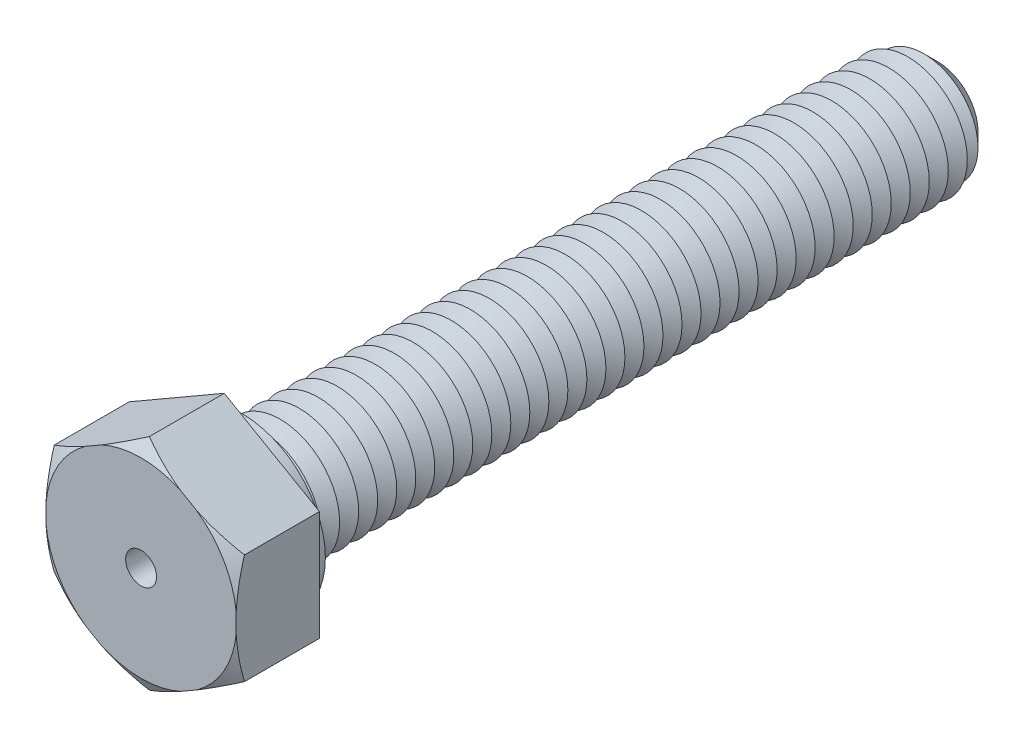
ISO-10303-21;
HEADER;
FILE_DESCRIPTION(('STEP AP214'),'2;1');
FILE_NAME('part.step','',(''),(''),'','','');
FILE_SCHEMA(('AUTOMOTIVE_DESIGN { 1 0 10303 214 1 1 1 1 }'));
ENDSEC;
DATA;
#1=APPLICATION_CONTEXT('core data for automotive mechanical design processes');
#2=APPLICATION_PROTOCOL_DEFINITION('international standard','automotive_design',2000,#1);
#3=PRODUCT_CONTEXT('',#1,'mechanical');
#4=PRODUCT('Part','Part','',(#3));
#5=PRODUCT_RELATED_PRODUCT_CATEGORY('part','',(#4));
#6=PRODUCT_DEFINITION_FORMATION('','',#4);
#7=PRODUCT_DEFINITION_CONTEXT('part definition',#1,'design');
#8=PRODUCT_DEFINITION('design','',#6,#7);
#9=PRODUCT_DEFINITION_SHAPE('','',#8);
#10=(LENGTH_UNIT() NAMED_UNIT(*) SI_UNIT(.MILLI.,.METRE.));
#11=(NAMED_UNIT(*) PLANE_ANGLE_UNIT() SI_UNIT($,.RADIAN.));
#12=(NAMED_UNIT(*) SI_UNIT($,.STERADIAN.) SOLID_ANGLE_UNIT());
#13=UNCERTAINTY_MEASURE_WITH_UNIT(LENGTH_MEASURE(1.E-05),#10,'distance_accuracy_value','');
#14=(GEOMETRIC_REPRESENTATION_CONTEXT(3) GLOBAL_UNCERTAINTY_ASSIGNED_CONTEXT((#13)) GLOBAL_UNIT_ASSIGNED_CONTEXT((#10,
#11,#12)) REPRESENTATION_CONTEXT('',''));
#15=CARTESIAN_POINT('',(0.,0.,0.));
#16=DIRECTION('',(0.,0.,1.));
#17=DIRECTION('',(1.,0.,0.));
#18=AXIS2_PLACEMENT_3D('',#15,#16,#17);
#19=CARTESIAN_POINT('',(4.,2.3094010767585,3.5));
#20=DIRECTION('',(-0.5,-0.866025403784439,0.));
#21=DIRECTION('',(0.866025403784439,-0.5,0.));
#22=AXIS2_PLACEMENT_3D('',#19,#20,#21);
#23=PLANE('',#22);
#24=CARTESIAN_POINT('',(6.77926459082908,0.704791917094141,1.88515125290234));
#25=CARTESIAN_POINT('',(6.65357706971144,0.777357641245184,1.95298106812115));
#26=CARTESIAN_POINT('',(6.52758896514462,0.850096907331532,2.02007962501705));
#27=CARTESIAN_POINT('',(6.2748848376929,0.995995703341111,2.15247084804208));
#28=CARTESIAN_POINT('',(6.14816872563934,1.06915528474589,2.21776328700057));
#29=CARTESIAN_POINT('',(5.8935057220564,1.21618503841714,2.34638757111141));
#30=CARTESIAN_POINT('',(5.76555618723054,1.29005673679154,2.40971246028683));
#31=CARTESIAN_POINT('',(5.50869902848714,1.43835328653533,2.53371033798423));
#32=CARTESIAN_POINT('',(5.37979143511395,1.51277812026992,2.59438341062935));
#33=CARTESIAN_POINT('',(5.11756014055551,1.66417742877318,2.7140043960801));
#34=CARTESIAN_POINT('',(4.98420771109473,1.74116848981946,2.77286873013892));
#35=CARTESIAN_POINT('',(4.7161724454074,1.89591872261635,2.88640197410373));
#36=CARTESIAN_POINT('',(4.58148968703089,1.97367784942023,2.94107112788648));
#37=CARTESIAN_POINT('',(4.31074083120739,2.12999477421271,3.0451841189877));
#38=CARTESIAN_POINT('',(4.17467611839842,2.20855177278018,3.09463271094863));
#39=CARTESIAN_POINT('',(3.90094921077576,2.36658807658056,3.18716064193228));
#40=CARTESIAN_POINT('',(3.76328722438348,2.44606726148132,3.23024080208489));
#41=CARTESIAN_POINT('',(3.43409497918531,2.63612649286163,3.32342391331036));
#42=CARTESIAN_POINT('',(3.24179802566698,2.74714919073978,3.37006382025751));
#43=CARTESIAN_POINT('',(2.95137883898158,2.91482278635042,3.4261412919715));
#44=CARTESIAN_POINT('',(2.85424512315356,2.97090296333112,3.44251989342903));
#45=CARTESIAN_POINT('',(2.65944416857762,3.08337134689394,3.47023794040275));
#46=CARTESIAN_POINT('',(2.56177700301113,3.13975951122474,3.48157806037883));
#47=CARTESIAN_POINT('',(2.36721602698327,3.25208934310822,3.49879538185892));
#48=CARTESIAN_POINT('',(2.27032632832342,3.30802863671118,3.50473421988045));
#49=CARTESIAN_POINT('',(2.07641108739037,3.41998565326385,3.51119583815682));
#50=CARTESIAN_POINT('',(1.97938554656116,3.47600337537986,3.51171867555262));
#51=CARTESIAN_POINT('',(1.78542763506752,3.58798502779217,3.50733170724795));
#52=CARTESIAN_POINT('',(1.68849526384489,3.64394895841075,3.50242193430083));
#53=CARTESIAN_POINT('',(1.49492986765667,3.75570399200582,3.48731840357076));
#54=CARTESIAN_POINT('',(1.39829689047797,3.81149506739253,3.47712384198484));
#55=CARTESIAN_POINT('',(1.1701117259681,3.94323783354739,3.44706969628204));
#56=CARTESIAN_POINT('',(1.03877271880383,4.01906644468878,3.42503535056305));
#57=CARTESIAN_POINT('',(0.777349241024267,4.16999935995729,3.37264454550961));
#58=CARTESIAN_POINT('',(0.64726495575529,4.24510355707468,3.34228687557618));
#59=CARTESIAN_POINT('',(0.388367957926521,4.3945778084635,3.27439527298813));
#60=CARTESIAN_POINT('',(0.259556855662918,4.46894693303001,3.2368532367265));
#61=CARTESIAN_POINT('',(0.00337956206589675,4.61685096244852,3.15577578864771));
#62=CARTESIAN_POINT('',(-0.123986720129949,4.69038591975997,3.11224075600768));
#63=CARTESIAN_POINT('',(-0.378873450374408,4.83754484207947,3.01966290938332));
#64=CARTESIAN_POINT('',(-0.506377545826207,4.91115936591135,2.97056048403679));
#65=CARTESIAN_POINT('',(-0.760034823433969,5.0576084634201,2.86822484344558));
#66=CARTESIAN_POINT('',(-0.886188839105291,5.13044351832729,2.81499436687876));
#67=CARTESIAN_POINT('',(-1.13734672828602,5.27544959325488,2.70513446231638));
#68=CARTESIAN_POINT('',(-1.26235083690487,5.34762074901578,2.6485057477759));
#69=CARTESIAN_POINT('',(-1.5113783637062,5.49139685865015,2.53244390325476));
#70=CARTESIAN_POINT('',(-1.63540176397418,5.56300180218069,2.47301072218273));
#71=CARTESIAN_POINT('',(-1.84520240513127,5.68413025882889,2.37015667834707));
#72=CARTESIAN_POINT('',(-1.93119941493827,5.73378065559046,2.32733101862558));
#73=CARTESIAN_POINT('',(-2.1028145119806,5.83286267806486,2.24068817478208));
#74=CARTESIAN_POINT('',(-2.18843261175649,5.88229431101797,2.19687102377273));
#75=CARTESIAN_POINT('',(-2.3584228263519,5.98043820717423,2.10883190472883));
#76=CARTESIAN_POINT('',(-2.44279852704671,6.02915254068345,2.06461915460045));
#77=CARTESIAN_POINT('',(-2.61124951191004,6.12640776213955,1.97543229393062));
#78=CARTESIAN_POINT('',(-2.6953247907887,6.17494864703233,1.93045817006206));
#79=CARTESIAN_POINT('',(-2.77926459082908,6.22341131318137,1.88515125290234));
#80=B_SPLINE_CURVE_WITH_KNOTS('',3,(#24,#25,#26,#27,#28,#29,#30,#31,#32,#33,#34,#35,#36,#37,#38,
#39,#40,#41,#42,#43,#44,#45,#46,#47,#48,#49,#50,#51,#52,#53,#54,#55,#56,#57,#58,#59,#60,#61,#62,
#63,#64,#65,#66,#67,#68,#69,#70,#71,#72,#73,#74,#75,#76,#77,#78,#79),.UNSPECIFIED.,.F.,.F.,(4,2,
2,2,2,2,2,2,2,2,2,2,2,2,2,2,2,2,2,2,2,2,2,2,2,2,2,4),(0.,0.480604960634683,0.96127009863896,
1.44347608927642,1.92566677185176,2.42016676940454,2.91463799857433,3.4086549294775,
3.9026081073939,4.58254272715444,4.92249867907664,5.26240911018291,5.59839013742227,
5.93436761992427,6.27034307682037,6.60636964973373,7.06584039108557,7.52537799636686,
7.98543702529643,8.44546695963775,8.91099531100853,9.37621741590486,9.84134218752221,
10.3064754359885,10.6308960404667,10.9553058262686,11.2762760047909,11.5972518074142),.UNSPECIFIED.);
#81=CARTESIAN_POINT('',(4.,2.3094010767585,3.15358983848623));
#82=VERTEX_POINT('',#81);
#83=CARTESIAN_POINT('',(2.33627081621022,3.26995556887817,3.5));
#84=VERTEX_POINT('',#83);
#85=EDGE_CURVE('E132',#82,#84,#80,.T.);
#86=ORIENTED_EDGE('',*,*,#85,.F.);
#87=DIRECTION('',(0.,0.,-1.));
#88=VECTOR('',#87,1.);
#89=CARTESIAN_POINT('',(4.,2.3094010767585,3.5));
#90=LINE('',#89,#88);
#91=CARTESIAN_POINT('',(4.,2.3094010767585,0.));
#92=VERTEX_POINT('',#91);
#93=EDGE_CURVE('E144',#82,#92,#90,.T.);
#94=ORIENTED_EDGE('',*,*,#93,.T.);
#95=DIRECTION('',(-0.866025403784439,0.5,0.));
#96=VECTOR('',#95,1.);
#97=CARTESIAN_POINT('',(4.,2.3094010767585,0.));
#98=LINE('',#97,#96);
#99=CARTESIAN_POINT('',(0.,4.618802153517,0.));
#100=VERTEX_POINT('',#99);
#101=EDGE_CURVE('E490',#92,#100,#98,.T.);
#102=ORIENTED_EDGE('',*,*,#101,.T.);
#103=DIRECTION('',(0.,0.,-1.));
#104=VECTOR('',#103,1.);
#105=CARTESIAN_POINT('',(0.,4.618802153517,3.5));
#106=LINE('',#105,#104);
#107=CARTESIAN_POINT('',(0.,4.61880215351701,3.15358983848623));
#108=VERTEX_POINT('',#107);
#109=EDGE_CURVE('E179',#108,#100,#106,.T.);
#110=ORIENTED_EDGE('',*,*,#109,.F.);
#111=CARTESIAN_POINT('',(1.66372918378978,3.65824766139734,3.5));
#112=VERTEX_POINT('',#111);
#113=EDGE_CURVE('E151',#112,#108,#80,.T.);
#114=ORIENTED_EDGE('',*,*,#113,.F.);
#115=DIRECTION('',(-0.866025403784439,0.5,0.));
#116=VECTOR('',#115,1.);
#117=CARTESIAN_POINT('',(4.,2.3094010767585,3.5));
#118=LINE('',#117,#116);
#119=EDGE_CURVE('E148',#84,#112,#118,.T.);
#120=ORIENTED_EDGE('',*,*,#119,.F.);
#121=EDGE_LOOP('',(#86,#94,#102,#110,#114,#120));
#122=FACE_BOUND('',#121,.T.);
#123=ADVANCED_FACE('F39',(#122),#23,.F.);
#124=CARTESIAN_POINT('',(0.,4.618802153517,3.5));
#125=DIRECTION('',(0.5,-0.866025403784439,0.));
#126=DIRECTION('',(0.866025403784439,0.5,0.));
#127=AXIS2_PLACEMENT_3D('',#124,#125,#126);
#128=PLANE('',#127);
#129=CARTESIAN_POINT('',(2.77926459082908,6.22341131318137,1.88515125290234));
#130=CARTESIAN_POINT('',(2.65357706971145,6.15084558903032,1.95298106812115));
#131=CARTESIAN_POINT('',(2.52758896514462,6.07810632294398,2.02007962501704));
#132=CARTESIAN_POINT('',(2.2748848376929,5.9322075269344,2.15247084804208));
#133=CARTESIAN_POINT('',(2.14816872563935,5.85904794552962,2.21776328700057));
#134=CARTESIAN_POINT('',(1.89350572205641,5.71201819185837,2.3463875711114));
#135=CARTESIAN_POINT('',(1.76555618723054,5.63814649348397,2.40971246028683));
#136=CARTESIAN_POINT('',(1.50869902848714,5.48984994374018,2.53371033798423));
#137=CARTESIAN_POINT('',(1.37979143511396,5.41542511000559,2.59438341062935));
#138=CARTESIAN_POINT('',(1.11756014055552,5.26402580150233,2.7140043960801));
#139=CARTESIAN_POINT('',(0.984207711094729,5.18703474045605,2.77286873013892));
#140=CARTESIAN_POINT('',(0.716172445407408,5.03228450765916,2.88640197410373));
#141=CARTESIAN_POINT('',(0.581489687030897,4.95452538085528,2.94107112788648));
#142=CARTESIAN_POINT('',(0.310740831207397,4.7982084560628,3.0451841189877));
#143=CARTESIAN_POINT('',(0.174676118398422,4.71965145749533,3.09463271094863));
#144=CARTESIAN_POINT('',(-0.0990507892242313,4.56161515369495,3.18716064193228));
#145=CARTESIAN_POINT('',(-0.236712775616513,4.48213596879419,3.23024080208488));
#146=CARTESIAN_POINT('',(-0.565905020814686,4.29207673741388,3.32342391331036));
#147=CARTESIAN_POINT('',(-0.758201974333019,4.18105403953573,3.37006382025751));
#148=CARTESIAN_POINT('',(-1.04862116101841,4.01338044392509,3.4261412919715));
#149=CARTESIAN_POINT('',(-1.14575487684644,3.95730026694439,3.44251989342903));
#150=CARTESIAN_POINT('',(-1.34055583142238,3.84483188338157,3.47023794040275));
#151=CARTESIAN_POINT('',(-1.43822299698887,3.78844371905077,3.48157806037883));
#152=CARTESIAN_POINT('',(-1.63278397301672,3.67611388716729,3.49879538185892));
#153=CARTESIAN_POINT('',(-1.72967367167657,3.62017459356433,3.50473421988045));
#154=CARTESIAN_POINT('',(-1.92358891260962,3.50821757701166,3.51119583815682));
#155=CARTESIAN_POINT('',(-2.02061445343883,3.45219985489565,3.51171867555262));
#156=CARTESIAN_POINT('',(-2.21457236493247,3.34021820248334,3.50733170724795));
#157=CARTESIAN_POINT('',(-2.3115047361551,3.28425427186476,3.50242193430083));
#158=CARTESIAN_POINT('',(-2.50507013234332,3.1724992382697,3.48731840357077));
#159=CARTESIAN_POINT('',(-2.60170310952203,3.11670816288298,3.47712384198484));
#160=CARTESIAN_POINT('',(-2.82988827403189,2.98496539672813,3.44706969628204));
#161=CARTESIAN_POINT('',(-2.96122728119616,2.90913678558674,3.42503535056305));
#162=CARTESIAN_POINT('',(-3.22265075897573,2.75820387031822,3.37264454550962));
#163=CARTESIAN_POINT('',(-3.3527350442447,2.68309967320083,3.34228687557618));
#164=CARTESIAN_POINT('',(-3.61163204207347,2.53362542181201,3.27439527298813));
#165=CARTESIAN_POINT('',(-3.74044314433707,2.4592562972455,3.23685323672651));
#166=CARTESIAN_POINT('',(-3.99662043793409,2.311352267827,3.15577578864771));
#167=CARTESIAN_POINT('',(-4.12398672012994,2.23781731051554,3.11224075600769));
#168=CARTESIAN_POINT('',(-4.3788734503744,2.09065838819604,3.01966290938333));
#169=CARTESIAN_POINT('',(-4.5063775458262,2.01704386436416,2.97056048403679));
#170=CARTESIAN_POINT('',(-4.76003482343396,1.87059476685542,2.86822484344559));
#171=CARTESIAN_POINT('',(-4.88618883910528,1.79775971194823,2.81499436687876));
#172=CARTESIAN_POINT('',(-5.13734672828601,1.65275363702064,2.70513446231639));
#173=CARTESIAN_POINT('',(-5.26235083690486,1.58058248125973,2.64850574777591));
#174=CARTESIAN_POINT('',(-5.51137836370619,1.43680637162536,2.53244390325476));
#175=CARTESIAN_POINT('',(-5.63540176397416,1.36520142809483,2.47301072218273));
#176=CARTESIAN_POINT('',(-5.84520240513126,1.24407297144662,2.37015667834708));
#177=CARTESIAN_POINT('',(-5.93119941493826,1.19442257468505,2.32733101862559));
#178=CARTESIAN_POINT('',(-6.1028145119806,1.09534055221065,2.24068817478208));
#179=CARTESIAN_POINT('',(-6.18843261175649,1.04590891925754,2.19687102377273));
#180=CARTESIAN_POINT('',(-6.3584228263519,0.947765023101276,2.10883190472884));
#181=CARTESIAN_POINT('',(-6.44279852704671,0.899050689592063,2.06461915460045));
#182=CARTESIAN_POINT('',(-6.61124951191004,0.80179546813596,1.97543229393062));
#183=CARTESIAN_POINT('',(-6.6953247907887,0.753254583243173,1.93045817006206));
#184=CARTESIAN_POINT('',(-6.77926459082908,0.704791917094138,1.88515125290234));
#185=B_SPLINE_CURVE_WITH_KNOTS('',3,(#129,#130,#131,#132,#133,#134,#135,#136,#137,#138,#139,
#140,#141,#142,#143,#144,#145,#146,#147,#148,#149,#150,#151,#152,#153,#154,#155,#156,#157,#158,
#159,#160,#161,#162,#163,#164,#165,#166,#167,#168,#169,#170,#171,#172,#173,#174,#175,#176,#177,
#178,#179,#180,#181,#182,#183,#184),.UNSPECIFIED.,.F.,.F.,(4,2,2,2,2,2,2,2,2,2,2,2,2,2,2,2,2,2,
2,2,2,2,2,2,2,2,2,4),(0.,0.480604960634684,0.961270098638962,1.44347608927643,1.92566677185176,
2.42016676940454,2.91463799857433,3.4086549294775,3.9026081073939,4.58254272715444,
4.92249867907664,5.26240911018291,5.59839013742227,5.93436761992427,6.27034307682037,
6.60636964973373,7.06584039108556,7.52537799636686,7.98543702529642,8.44546695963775,
8.91099531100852,9.37621741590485,9.8413421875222,10.3064754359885,10.6308960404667,
10.9553058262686,11.2762760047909,11.5972518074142),.UNSPECIFIED.);
#186=CARTESIAN_POINT('',(-1.66372918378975,3.65824766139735,3.5));
#187=VERTEX_POINT('',#186);
#188=EDGE_CURVE('E537',#108,#187,#185,.T.);
#189=ORIENTED_EDGE('',*,*,#188,.F.);
#190=ORIENTED_EDGE('',*,*,#109,.T.);
#191=DIRECTION('',(-0.866025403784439,-0.5,0.));
#192=VECTOR('',#191,1.);
#193=CARTESIAN_POINT('',(0.,4.618802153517,0.));
#194=LINE('',#193,#192);
#195=CARTESIAN_POINT('',(-4.,2.3094010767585,0.));
#196=VERTEX_POINT('',#195);
#197=EDGE_CURVE('E509',#100,#196,#194,.T.);
#198=ORIENTED_EDGE('',*,*,#197,.T.);
#199=DIRECTION('',(0.,0.,-1.));
#200=VECTOR('',#199,1.);
#201=CARTESIAN_POINT('',(-4.,2.3094010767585,3.5));
#202=LINE('',#201,#200);
#203=CARTESIAN_POINT('',(-4.,2.3094010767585,3.15358983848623));
#204=VERTEX_POINT('',#203);
#205=EDGE_CURVE('E176',#204,#196,#202,.T.);
#206=ORIENTED_EDGE('',*,*,#205,.F.);
#207=CARTESIAN_POINT('',(-2.33627081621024,3.26995556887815,3.5));
#208=VERTEX_POINT('',#207);
#209=EDGE_CURVE('E536',#208,#204,#185,.T.);
#210=ORIENTED_EDGE('',*,*,#209,.F.);
#211=DIRECTION('',(-0.866025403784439,-0.5,0.));
#212=VECTOR('',#211,1.);
#213=CARTESIAN_POINT('',(0.,4.618802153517,3.5));
#214=LINE('',#213,#212);
#215=EDGE_CURVE('E493',#187,#208,#214,.T.);
#216=ORIENTED_EDGE('',*,*,#215,.F.);
#217=EDGE_LOOP('',(#189,#190,#198,#206,#210,#216));
#218=FACE_BOUND('',#217,.T.);
#219=ADVANCED_FACE('F554',(#218),#128,.F.);
#220=CARTESIAN_POINT('',(-4.,2.3094010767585,3.5));
#221=DIRECTION('',(1.,0.,0.));
#222=DIRECTION('',(0.,0.,-1.));
#223=AXIS2_PLACEMENT_3D('',#220,#221,#222);
#224=PLANE('',#223);
#225=CARTESIAN_POINT('',(-4.,5.08866566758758,2.08330060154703));
#226=CARTESIAN_POINT('',(-4.,4.94414615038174,2.14888120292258));
#227=CARTESIAN_POINT('',(-4.,4.79923170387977,2.21360759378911));
#228=CARTESIAN_POINT('',(-4.,4.5084433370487,2.34093771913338));
#229=CARTESIAN_POINT('',(-4.,4.36256924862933,2.4035410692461));
#230=CARTESIAN_POINT('',(-4.,4.06913305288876,2.52644280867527));
#231=CARTESIAN_POINT('',(-4.,3.92156644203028,2.58673049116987));
#232=CARTESIAN_POINT('',(-4.,3.62518774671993,2.70415001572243));
#233=CARTESIAN_POINT('',(-4.,3.47637571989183,2.76128200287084));
#234=CARTESIAN_POINT('',(-4.,3.17798204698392,2.87144502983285));
#235=CARTESIAN_POINT('',(-4.,3.02840679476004,2.92449322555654));
#236=CARTESIAN_POINT('',(-4.,2.72767549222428,3.02589725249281));
#237=CARTESIAN_POINT('',(-4.,2.57651933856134,3.07425277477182));
#238=CARTESIAN_POINT('',(-4.,2.12084922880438,3.21062944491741));
#239=CARTESIAN_POINT('',(-4.,1.81364350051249,3.29014850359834));
#240=CARTESIAN_POINT('',(-4.,1.28033133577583,3.39840613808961));
#241=CARTESIAN_POINT('',(-4.,1.05588972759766,3.43514774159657));
#242=CARTESIAN_POINT('',(-4.,0.717455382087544,3.47487260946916));
#243=CARTESIAN_POINT('',(-4.,0.604348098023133,3.48554965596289));
#244=CARTESIAN_POINT('',(-4.,0.377758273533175,3.50148677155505));
#245=CARTESIAN_POINT('',(-4.,0.264275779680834,3.50674748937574));
#246=CARTESIAN_POINT('',(-4.,0.0372413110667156,3.51168400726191));
#247=CARTESIAN_POINT('',(-4.,-0.0763106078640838,3.51136237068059));
#248=CARTESIAN_POINT('',(-4.,-0.303259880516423,3.50515259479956));
#249=CARTESIAN_POINT('',(-4.,-0.416657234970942,3.49926448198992));
#250=CARTESIAN_POINT('',(-4.,-0.643045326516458,3.48210091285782));
#251=CARTESIAN_POINT('',(-4.,-0.756036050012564,3.47082527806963));
#252=CARTESIAN_POINT('',(-4.,-0.981405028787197,3.44321260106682));
#253=CARTESIAN_POINT('',(-4.,-1.09378317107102,3.42687465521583));
#254=CARTESIAN_POINT('',(-4.,-1.54188975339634,3.35219605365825));
#255=CARTESIAN_POINT('',(-4.,-1.87460189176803,3.27522286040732));
#256=CARTESIAN_POINT('',(-4.,-2.36751874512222,3.1379521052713));
#257=CARTESIAN_POINT('',(-4.,-2.53101356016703,3.08847923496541));
#258=CARTESIAN_POINT('',(-4.,-2.85611626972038,2.98363580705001));
#259=CARTESIAN_POINT('',(-4.,-3.01772429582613,2.92826566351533));
#260=CARTESIAN_POINT('',(-4.,-3.34106601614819,2.81212836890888));
#261=CARTESIAN_POINT('',(-4.,-3.50277978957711,2.75130648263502));
#262=CARTESIAN_POINT('',(-4.,-3.82469686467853,2.62576992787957));
#263=CARTESIAN_POINT('',(-4.,-3.98490007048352,2.56105501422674));
#264=CARTESIAN_POINT('',(-4.,-4.30300593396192,2.4289095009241));
#265=CARTESIAN_POINT('',(-4.,-4.46091670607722,2.36149833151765));
#266=CARTESIAN_POINT('',(-4.,-4.7755935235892,2.22415533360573));
#267=CARTESIAN_POINT('',(-4.,-4.93235984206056,2.15422413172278));
#268=CARTESIAN_POINT('',(-4.,-5.08866566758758,2.08330060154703));
#269=B_SPLINE_CURVE_WITH_KNOTS('',3,(#225,#226,#227,#228,#229,#230,#231,#232,#233,#234,#235,
#236,#237,#238,#239,#240,#241,#242,#243,#244,#245,#246,#247,#248,#249,#250,#251,#252,#253,#254,
#255,#256,#257,#258,#259,#260,#261,#262,#263,#264,#265,#266,#267,#268),.UNSPECIFIED.,.F.,.F.,(4,
2,2,2,2,2,2,2,2,2,2,2,2,2,2,2,2,2,2,2,2,4),(0.,0.476116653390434,0.952319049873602,
1.43050831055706,1.90867556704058,2.38470991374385,2.8607755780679,3.81133518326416,
4.49276221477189,4.83347879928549,5.17415457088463,5.51467391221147,5.85519163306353,
6.19572063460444,6.53631045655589,7.5583874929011,8.07079781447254,8.58317218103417,
9.1014378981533,9.61973628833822,10.1348057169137,10.6497479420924),.UNSPECIFIED.);
#270=CARTESIAN_POINT('',(-4.,0.388292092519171,3.5));
#271=VERTEX_POINT('',#270);
#272=EDGE_CURVE('E538',#204,#271,#269,.T.);
#273=ORIENTED_EDGE('',*,*,#272,.F.);
#274=ORIENTED_EDGE('',*,*,#205,.T.);
#275=DIRECTION('',(0.,-1.,0.));
#276=VECTOR('',#275,1.);
#277=CARTESIAN_POINT('',(-4.,2.3094010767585,0.));
#278=LINE('',#277,#276);
#279=CARTESIAN_POINT('',(-4.,-2.3094010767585,0.));
#280=VERTEX_POINT('',#279);
#281=EDGE_CURVE('E512',#196,#280,#278,.T.);
#282=ORIENTED_EDGE('',*,*,#281,.T.);
#283=DIRECTION('',(0.,0.,-1.));
#284=VECTOR('',#283,1.);
#285=CARTESIAN_POINT('',(-4.,-2.3094010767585,3.5));
#286=LINE('',#285,#284);
#287=CARTESIAN_POINT('',(-4.,-2.30940107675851,3.15358983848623));
#288=VERTEX_POINT('',#287);
#289=EDGE_CURVE('E173',#288,#280,#286,.T.);
#290=ORIENTED_EDGE('',*,*,#289,.F.);
#291=CARTESIAN_POINT('',(-4.,-0.388292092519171,3.5));
#292=VERTEX_POINT('',#291);
#293=EDGE_CURVE('E530',#292,#288,#269,.T.);
#294=ORIENTED_EDGE('',*,*,#293,.F.);
#295=DIRECTION('',(0.,-1.,0.));
#296=VECTOR('',#295,1.);
#297=CARTESIAN_POINT('',(-4.,2.3094010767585,3.5));
#298=LINE('',#297,#296);
#299=EDGE_CURVE('E497',#271,#292,#298,.T.);
#300=ORIENTED_EDGE('',*,*,#299,.F.);
#301=EDGE_LOOP('',(#273,#274,#282,#290,#294,#300));
#302=FACE_BOUND('',#301,.T.);
#303=ADVANCED_FACE('F592',(#302),#224,.F.);
#304=CARTESIAN_POINT('',(-4.,-2.3094010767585,3.5));
#305=DIRECTION('',(0.5,0.866025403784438,0.));
#306=DIRECTION('',(-0.866025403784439,0.5,0.));
#307=AXIS2_PLACEMENT_3D('',#304,#305,#306);
#308=PLANE('',#307);
#309=CARTESIAN_POINT('',(-6.77926459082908,-0.704791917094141,1.88515125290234));
#310=CARTESIAN_POINT('',(-6.65357706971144,-0.777357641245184,1.95298106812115));
#311=CARTESIAN_POINT('',(-6.52758896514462,-0.850096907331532,2.02007962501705));
#312=CARTESIAN_POINT('',(-6.2748848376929,-0.995995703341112,2.15247084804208));
#313=CARTESIAN_POINT('',(-6.14816872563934,-1.06915528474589,2.21776328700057));
#314=CARTESIAN_POINT('',(-5.8935057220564,-1.21618503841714,2.34638757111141));
#315=CARTESIAN_POINT('',(-5.76555618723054,-1.29005673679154,2.40971246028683));
#316=CARTESIAN_POINT('',(-5.50869902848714,-1.43835328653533,2.53371033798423));
#317=CARTESIAN_POINT('',(-5.37979143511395,-1.51277812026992,2.59438341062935));
#318=CARTESIAN_POINT('',(-5.11756014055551,-1.66417742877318,2.71400439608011));
#319=CARTESIAN_POINT('',(-4.98420771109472,-1.74116848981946,2.77286873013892));
#320=CARTESIAN_POINT('',(-4.7161724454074,-1.89591872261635,2.88640197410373));
#321=CARTESIAN_POINT('',(-4.58148968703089,-1.97367784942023,2.94107112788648));
#322=CARTESIAN_POINT('',(-4.31074083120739,-2.12999477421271,3.0451841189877));
#323=CARTESIAN_POINT('',(-4.17467611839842,-2.20855177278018,3.09463271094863));
#324=CARTESIAN_POINT('',(-3.90094921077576,-2.36658807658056,3.18716064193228));
#325=CARTESIAN_POINT('',(-3.76328722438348,-2.44606726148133,3.23024080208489));
#326=CARTESIAN_POINT('',(-3.43409497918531,-2.63612649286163,3.32342391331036));
#327=CARTESIAN_POINT('',(-3.24179802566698,-2.74714919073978,3.3700638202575));
#328=CARTESIAN_POINT('',(-2.95137883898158,-2.91482278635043,3.4261412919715));
#329=CARTESIAN_POINT('',(-2.85424512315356,-2.97090296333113,3.44251989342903));
#330=CARTESIAN_POINT('',(-2.65944416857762,-3.08337134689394,3.47023794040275));
#331=CARTESIAN_POINT('',(-2.56177700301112,-3.13975951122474,3.48157806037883));
#332=CARTESIAN_POINT('',(-2.36721602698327,-3.25208934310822,3.49879538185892));
#333=CARTESIAN_POINT('',(-2.27032632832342,-3.30802863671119,3.50473421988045));
#334=CARTESIAN_POINT('',(-2.07641108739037,-3.41998565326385,3.51119583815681));
#335=CARTESIAN_POINT('',(-1.97938554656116,-3.47600337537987,3.51171867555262));
#336=CARTESIAN_POINT('',(-1.78542763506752,-3.58798502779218,3.50733170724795));
#337=CARTESIAN_POINT('',(-1.68849526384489,-3.64394895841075,3.50242193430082));
#338=CARTESIAN_POINT('',(-1.49492986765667,-3.75570399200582,3.48731840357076));
#339=CARTESIAN_POINT('',(-1.39829689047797,-3.81149506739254,3.47712384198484));
#340=CARTESIAN_POINT('',(-1.1701117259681,-3.94323783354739,3.44706969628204));
#341=CARTESIAN_POINT('',(-1.03877271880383,-4.01906644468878,3.42503535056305));
#342=CARTESIAN_POINT('',(-0.777349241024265,-4.1699993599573,3.37264454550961));
#343=CARTESIAN_POINT('',(-0.647264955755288,-4.24510355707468,3.34228687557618));
#344=CARTESIAN_POINT('',(-0.388367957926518,-4.39457780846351,3.27439527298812));
#345=CARTESIAN_POINT('',(-0.259556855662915,-4.46894693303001,3.2368532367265));
#346=CARTESIAN_POINT('',(-0.00337956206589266,-4.61685096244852,3.1557757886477));
#347=CARTESIAN_POINT('',(0.123986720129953,-4.69038591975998,3.11224075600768));
#348=CARTESIAN_POINT('',(0.378873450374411,-4.83754484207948,3.01966290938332));
#349=CARTESIAN_POINT('',(0.50637754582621,-4.91115936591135,2.97056048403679));
#350=CARTESIAN_POINT('',(0.760034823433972,-5.0576084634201,2.86822484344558));
#351=CARTESIAN_POINT('',(0.886188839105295,-5.13044351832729,2.81499436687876));
#352=CARTESIAN_POINT('',(1.13734672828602,-5.27544959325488,2.70513446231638));
#353=CARTESIAN_POINT('',(1.26235083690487,-5.34762074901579,2.6485057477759));
#354=CARTESIAN_POINT('',(1.5113783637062,-5.49139685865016,2.53244390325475));
#355=CARTESIAN_POINT('',(1.63540176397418,-5.56300180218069,2.47301072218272));
#356=CARTESIAN_POINT('',(1.84520240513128,-5.6841302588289,2.37015667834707));
#357=CARTESIAN_POINT('',(1.93119941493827,-5.73378065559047,2.32733101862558));
#358=CARTESIAN_POINT('',(2.10281451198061,-5.83286267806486,2.24068817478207));
#359=CARTESIAN_POINT('',(2.1884326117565,-5.88229431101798,2.19687102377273));
#360=CARTESIAN_POINT('',(2.3584228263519,-5.98043820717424,2.10883190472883));
#361=CARTESIAN_POINT('',(2.44279852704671,-6.02915254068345,2.06461915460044));
#362=CARTESIAN_POINT('',(2.61124951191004,-6.12640776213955,1.97543229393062));
#363=CARTESIAN_POINT('',(2.6953247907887,-6.17494864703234,1.93045817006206));
#364=CARTESIAN_POINT('',(2.77926459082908,-6.22341131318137,1.88515125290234));
#365=B_SPLINE_CURVE_WITH_KNOTS('',3,(#309,#310,#311,#312,#313,#314,#315,#316,#317,#318,#319,
#320,#321,#322,#323,#324,#325,#326,#327,#328,#329,#330,#331,#332,#333,#334,#335,#336,#337,#338,
#339,#340,#341,#342,#343,#344,#345,#346,#347,#348,#349,#350,#351,#352,#353,#354,#355,#356,#357,
#358,#359,#360,#361,#362,#363,#364),.UNSPECIFIED.,.F.,.F.,(4,2,2,2,2,2,2,2,2,2,2,2,2,2,2,2,2,2,
2,2,2,2,2,2,2,2,2,4),(0.,0.480604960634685,0.961270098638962,1.44347608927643,1.92566677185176,
2.42016676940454,2.91463799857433,3.4086549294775,3.90260810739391,4.58254272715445,
4.92249867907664,5.26240911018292,5.59839013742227,5.93436761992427,6.27034307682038,
6.60636964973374,7.06584039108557,7.52537799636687,7.98543702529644,8.44546695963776,
8.91099531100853,9.37621741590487,9.84134218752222,10.3064754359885,10.6308960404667,
10.9553058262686,11.2762760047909,11.5972518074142),.UNSPECIFIED.);
#366=CARTESIAN_POINT('',(-2.3362708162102,-3.26995556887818,3.5));
#367=VERTEX_POINT('',#366);
#368=EDGE_CURVE('E528',#288,#367,#365,.T.);
#369=ORIENTED_EDGE('',*,*,#368,.F.);
#370=ORIENTED_EDGE('',*,*,#289,.T.);
#371=DIRECTION('',(0.866025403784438,-0.5,0.));
#372=VECTOR('',#371,1.);
#373=CARTESIAN_POINT('',(-4.,-2.3094010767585,0.));
#374=LINE('',#373,#372);
#375=CARTESIAN_POINT('',(0.,-4.61880215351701,0.));
#376=VERTEX_POINT('',#375);
#377=EDGE_CURVE('E516',#280,#376,#374,.T.);
#378=ORIENTED_EDGE('',*,*,#377,.T.);
#379=DIRECTION('',(0.,0.,-1.));
#380=VECTOR('',#379,1.);
#381=CARTESIAN_POINT('',(0.,-4.61880215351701,3.5));
#382=LINE('',#381,#380);
#383=CARTESIAN_POINT('',(0.,-4.618802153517,3.15358983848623));
#384=VERTEX_POINT('',#383);
#385=EDGE_CURVE('E163',#384,#376,#382,.T.);
#386=ORIENTED_EDGE('',*,*,#385,.F.);
#387=CARTESIAN_POINT('',(-1.6637291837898,-3.65824766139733,3.5));
#388=VERTEX_POINT('',#387);
#389=EDGE_CURVE('E531',#388,#384,#365,.T.);
#390=ORIENTED_EDGE('',*,*,#389,.F.);
#391=DIRECTION('',(0.866025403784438,-0.5,0.));
#392=VECTOR('',#391,1.);
#393=CARTESIAN_POINT('',(-4.,-2.3094010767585,3.5));
#394=LINE('',#393,#392);
#395=EDGE_CURVE('E500',#367,#388,#394,.T.);
#396=ORIENTED_EDGE('',*,*,#395,.F.);
#397=EDGE_LOOP('',(#369,#370,#378,#386,#390,#396));
#398=FACE_BOUND('',#397,.T.);
#399=ADVANCED_FACE('F588',(#398),#308,.F.);
#400=CARTESIAN_POINT('',(0.,-4.61880215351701,3.5));
#401=DIRECTION('',(-0.5,0.866025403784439,0.));
#402=DIRECTION('',(-0.866025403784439,-0.5,0.));
#403=AXIS2_PLACEMENT_3D('',#400,#401,#402);
#404=PLANE('',#403);
#405=CARTESIAN_POINT('',(-2.77926459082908,-6.22341131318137,1.88515125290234));
#406=CARTESIAN_POINT('',(-2.65357706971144,-6.15084558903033,1.95298106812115));
#407=CARTESIAN_POINT('',(-2.52758896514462,-6.07810632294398,2.02007962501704));
#408=CARTESIAN_POINT('',(-2.2748848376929,-5.9322075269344,2.15247084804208));
#409=CARTESIAN_POINT('',(-2.14816872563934,-5.85904794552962,2.21776328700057));
#410=CARTESIAN_POINT('',(-1.8935057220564,-5.71201819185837,2.3463875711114));
#411=CARTESIAN_POINT('',(-1.76555618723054,-5.63814649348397,2.40971246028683));
#412=CARTESIAN_POINT('',(-1.50869902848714,-5.48984994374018,2.53371033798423));
#413=CARTESIAN_POINT('',(-1.37979143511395,-5.41542511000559,2.59438341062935));
#414=CARTESIAN_POINT('',(-1.11756014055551,-5.26402580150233,2.7140043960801));
#415=CARTESIAN_POINT('',(-0.984207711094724,-5.18703474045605,2.77286873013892));
#416=CARTESIAN_POINT('',(-0.716172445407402,-5.03228450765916,2.88640197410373));
#417=CARTESIAN_POINT('',(-0.581489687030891,-4.95452538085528,2.94107112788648));
#418=CARTESIAN_POINT('',(-0.310740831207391,-4.7982084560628,3.0451841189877));
#419=CARTESIAN_POINT('',(-0.174676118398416,-4.71965145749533,3.09463271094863));
#420=CARTESIAN_POINT('',(0.0990507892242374,-4.56161515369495,3.18716064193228));
#421=CARTESIAN_POINT('',(0.236712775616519,-4.48213596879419,3.23024080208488));
#422=CARTESIAN_POINT('',(0.565905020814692,-4.29207673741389,3.32342391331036));
#423=CARTESIAN_POINT('',(0.758201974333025,-4.18105403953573,3.37006382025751));
#424=CARTESIAN_POINT('',(1.04862116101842,-4.01338044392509,3.4261412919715));
#425=CARTESIAN_POINT('',(1.14575487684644,-3.95730026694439,3.44251989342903));
#426=CARTESIAN_POINT('',(1.34055583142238,-3.84483188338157,3.47023794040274));
#427=CARTESIAN_POINT('',(1.43822299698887,-3.78844371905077,3.48157806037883));
#428=CARTESIAN_POINT('',(1.63278397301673,-3.67611388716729,3.49879538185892));
#429=CARTESIAN_POINT('',(1.72967367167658,-3.62017459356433,3.50473421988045));
#430=CARTESIAN_POINT('',(1.92358891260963,-3.50821757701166,3.51119583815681));
#431=CARTESIAN_POINT('',(2.02061445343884,-3.45219985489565,3.51171867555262));
#432=CARTESIAN_POINT('',(2.21457236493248,-3.34021820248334,3.50733170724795));
#433=CARTESIAN_POINT('',(2.31150473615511,-3.28425427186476,3.50242193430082));
#434=CARTESIAN_POINT('',(2.50507013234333,-3.1724992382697,3.48731840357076));
#435=CARTESIAN_POINT('',(2.60170310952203,-3.11670816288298,3.47712384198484));
#436=CARTESIAN_POINT('',(2.8298882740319,-2.98496539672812,3.44706969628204));
#437=CARTESIAN_POINT('',(2.96122728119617,-2.90913678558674,3.42503535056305));
#438=CARTESIAN_POINT('',(3.22265075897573,-2.75820387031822,3.37264454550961));
#439=CARTESIAN_POINT('',(3.35273504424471,-2.68309967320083,3.34228687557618));
#440=CARTESIAN_POINT('',(3.61163204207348,-2.53362542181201,3.27439527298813));
#441=CARTESIAN_POINT('',(3.74044314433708,-2.4592562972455,3.2368532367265));
#442=CARTESIAN_POINT('',(3.99662043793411,-2.31135226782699,3.15577578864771));
#443=CARTESIAN_POINT('',(4.12398672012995,-2.23781731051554,3.11224075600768));
#444=CARTESIAN_POINT('',(4.37887345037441,-2.09065838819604,3.01966290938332));
#445=CARTESIAN_POINT('',(4.50637754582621,-2.01704386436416,2.97056048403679));
#446=CARTESIAN_POINT('',(4.76003482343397,-1.87059476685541,2.86822484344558));
#447=CARTESIAN_POINT('',(4.8861888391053,-1.79775971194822,2.81499436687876));
#448=CARTESIAN_POINT('',(5.13734672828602,-1.65275363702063,2.70513446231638));
#449=CARTESIAN_POINT('',(5.26235083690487,-1.58058248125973,2.6485057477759));
#450=CARTESIAN_POINT('',(5.5113783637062,-1.43680637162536,2.53244390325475));
#451=CARTESIAN_POINT('',(5.63540176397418,-1.36520142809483,2.47301072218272));
#452=CARTESIAN_POINT('',(5.84520240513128,-1.24407297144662,2.37015667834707));
#453=CARTESIAN_POINT('',(5.93119941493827,-1.19442257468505,2.32733101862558));
#454=CARTESIAN_POINT('',(6.1028145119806,-1.09534055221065,2.24068817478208));
#455=CARTESIAN_POINT('',(6.1884326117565,-1.04590891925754,2.19687102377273));
#456=CARTESIAN_POINT('',(6.3584228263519,-0.947765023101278,2.10883190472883));
#457=CARTESIAN_POINT('',(6.44279852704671,-0.899050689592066,2.06461915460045));
#458=CARTESIAN_POINT('',(6.61124951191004,-0.801795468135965,1.97543229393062));
#459=CARTESIAN_POINT('',(6.6953247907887,-0.753254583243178,1.93045817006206));
#460=CARTESIAN_POINT('',(6.77926459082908,-0.704791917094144,1.88515125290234));
#461=B_SPLINE_CURVE_WITH_KNOTS('',3,(#405,#406,#407,#408,#409,#410,#411,#412,#413,#414,#415,
#416,#417,#418,#419,#420,#421,#422,#423,#424,#425,#426,#427,#428,#429,#430,#431,#432,#433,#434,
#435,#436,#437,#438,#439,#440,#441,#442,#443,#444,#445,#446,#447,#448,#449,#450,#451,#452,#453,
#454,#455,#456,#457,#458,#459,#460),.UNSPECIFIED.,.F.,.F.,(4,2,2,2,2,2,2,2,2,2,2,2,2,2,2,2,2,2,
2,2,2,2,2,2,2,2,2,4),(0.,0.480604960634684,0.961270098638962,1.44347608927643,1.92566677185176,
2.42016676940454,2.91463799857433,3.4086549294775,3.90260810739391,4.58254272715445,
4.92249867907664,5.26240911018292,5.59839013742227,5.93436761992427,6.27034307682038,
6.60636964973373,7.06584039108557,7.52537799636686,7.98543702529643,8.44546695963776,
8.91099531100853,9.37621741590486,9.84134218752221,10.3064754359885,10.6308960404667,
10.9553058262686,11.2762760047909,11.5972518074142),.UNSPECIFIED.);
#462=CARTESIAN_POINT('',(1.6637291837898,-3.65824766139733,3.5));
#463=VERTEX_POINT('',#462);
#464=EDGE_CURVE('E64',#384,#463,#461,.T.);
#465=ORIENTED_EDGE('',*,*,#464,.F.);
#466=ORIENTED_EDGE('',*,*,#385,.T.);
#467=DIRECTION('',(0.866025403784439,0.5,0.));
#468=VECTOR('',#467,1.);
#469=CARTESIAN_POINT('',(0.,-4.61880215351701,0.));
#470=LINE('',#469,#468);
#471=CARTESIAN_POINT('',(4.,-2.30940107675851,0.));
#472=VERTEX_POINT('',#471);
#473=EDGE_CURVE('E519',#376,#472,#470,.T.);
#474=ORIENTED_EDGE('',*,*,#473,.T.);
#475=DIRECTION('',(0.,0.,-1.));
#476=VECTOR('',#475,1.);
#477=CARTESIAN_POINT('',(4.,-2.30940107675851,3.5));
#478=LINE('',#477,#476);
#479=CARTESIAN_POINT('',(4.,-2.3094010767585,3.15358983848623));
#480=VERTEX_POINT('',#479);
#481=EDGE_CURVE('E157',#480,#472,#478,.T.);
#482=ORIENTED_EDGE('',*,*,#481,.F.);
#483=CARTESIAN_POINT('',(2.3362708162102,-3.26995556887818,3.5));
#484=VERTEX_POINT('',#483);
#485=EDGE_CURVE('E533',#484,#480,#461,.T.);
#486=ORIENTED_EDGE('',*,*,#485,.F.);
#487=DIRECTION('',(0.866025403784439,0.5,0.));
#488=VECTOR('',#487,1.);
#489=CARTESIAN_POINT('',(0.,-4.61880215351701,3.5));
#490=LINE('',#489,#488);
#491=EDGE_CURVE('E166',#463,#484,#490,.T.);
#492=ORIENTED_EDGE('',*,*,#491,.F.);
#493=EDGE_LOOP('',(#465,#466,#474,#482,#486,#492));
#494=FACE_BOUND('',#493,.T.);
#495=ADVANCED_FACE('F591',(#494),#404,.F.);
#496=CARTESIAN_POINT('',(4.,-2.30940107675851,3.5));
#497=DIRECTION('',(-1.,0.,0.));
#498=DIRECTION('',(0.,0.,1.));
#499=AXIS2_PLACEMENT_3D('',#496,#497,#498);
#500=PLANE('',#499);
#501=CARTESIAN_POINT('',(4.,-5.08866566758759,2.08330060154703));
#502=CARTESIAN_POINT('',(4.,-4.94414615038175,2.14888120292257));
#503=CARTESIAN_POINT('',(4.,-4.79923170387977,2.21360759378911));
#504=CARTESIAN_POINT('',(4.,-4.50844333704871,2.34093771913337));
#505=CARTESIAN_POINT('',(4.,-4.36256924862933,2.40354106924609));
#506=CARTESIAN_POINT('',(4.,-4.06913305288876,2.52644280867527));
#507=CARTESIAN_POINT('',(4.,-3.92156644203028,2.58673049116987));
#508=CARTESIAN_POINT('',(4.,-3.62518774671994,2.70415001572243));
#509=CARTESIAN_POINT('',(4.,-3.47637571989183,2.76128200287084));
#510=CARTESIAN_POINT('',(4.,-3.17798204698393,2.87144502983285));
#511=CARTESIAN_POINT('',(4.,-3.02840679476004,2.92449322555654));
#512=CARTESIAN_POINT('',(4.,-2.72767549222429,3.02589725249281));
#513=CARTESIAN_POINT('',(4.,-2.57651933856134,3.07425277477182));
#514=CARTESIAN_POINT('',(4.,-2.12084922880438,3.21062944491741));
#515=CARTESIAN_POINT('',(4.,-1.8136435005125,3.29014850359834));
#516=CARTESIAN_POINT('',(4.,-1.28033133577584,3.39840613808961));
#517=CARTESIAN_POINT('',(4.,-1.05588972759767,3.43514774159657));
#518=CARTESIAN_POINT('',(4.,-0.71745538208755,3.47487260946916));
#519=CARTESIAN_POINT('',(4.,-0.604348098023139,3.48554965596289));
#520=CARTESIAN_POINT('',(4.,-0.377758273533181,3.50148677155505));
#521=CARTESIAN_POINT('',(4.,-0.264275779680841,3.50674748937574));
#522=CARTESIAN_POINT('',(4.,-0.0372413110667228,3.51168400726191));
#523=CARTESIAN_POINT('',(4.,0.0763106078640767,3.51136237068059));
#524=CARTESIAN_POINT('',(4.,0.303259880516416,3.50515259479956));
#525=CARTESIAN_POINT('',(4.,0.416657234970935,3.49926448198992));
#526=CARTESIAN_POINT('',(4.,0.643045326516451,3.48210091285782));
#527=CARTESIAN_POINT('',(4.,0.756036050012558,3.47082527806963));
#528=CARTESIAN_POINT('',(4.,0.98140502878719,3.44321260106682));
#529=CARTESIAN_POINT('',(4.,1.09378317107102,3.42687465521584));
#530=CARTESIAN_POINT('',(4.,1.54188975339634,3.35219605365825));
#531=CARTESIAN_POINT('',(4.,1.87460189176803,3.27522286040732));
#532=CARTESIAN_POINT('',(4.,2.36751874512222,3.1379521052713));
#533=CARTESIAN_POINT('',(4.,2.53101356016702,3.08847923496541));
#534=CARTESIAN_POINT('',(4.,2.85611626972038,2.98363580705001));
#535=CARTESIAN_POINT('',(4.,3.01772429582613,2.92826566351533));
#536=CARTESIAN_POINT('',(4.,3.34106601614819,2.81212836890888));
#537=CARTESIAN_POINT('',(4.,3.50277978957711,2.75130648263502));
#538=CARTESIAN_POINT('',(4.,3.82469686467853,2.62576992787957));
#539=CARTESIAN_POINT('',(4.,3.98490007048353,2.56105501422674));
#540=CARTESIAN_POINT('',(4.,4.30300593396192,2.4289095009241));
#541=CARTESIAN_POINT('',(4.,4.46091670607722,2.36149833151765));
#542=CARTESIAN_POINT('',(4.,4.7755935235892,2.22415533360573));
#543=CARTESIAN_POINT('',(4.,4.93235984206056,2.15422413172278));
#544=CARTESIAN_POINT('',(4.,5.08866566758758,2.08330060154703));
#545=B_SPLINE_CURVE_WITH_KNOTS('',3,(#501,#502,#503,#504,#505,#506,#507,#508,#509,#510,#511,
#512,#513,#514,#515,#516,#517,#518,#519,#520,#521,#522,#523,#524,#525,#526,#527,#528,#529,#530,
#531,#532,#533,#534,#535,#536,#537,#538,#539,#540,#541,#542,#543,#544),.UNSPECIFIED.,.F.,.F.,(4,
2,2,2,2,2,2,2,2,2,2,2,2,2,2,2,2,2,2,2,2,4),(0.,0.476116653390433,0.952319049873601,
1.43050831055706,1.90867556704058,2.38470991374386,2.8607755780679,3.81133518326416,
4.49276221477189,4.83347879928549,5.17415457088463,5.51467391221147,5.85519163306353,
6.19572063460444,6.53631045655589,7.5583874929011,8.07079781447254,8.58317218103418,
9.10143789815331,9.61973628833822,10.1348057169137,10.6497479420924),.UNSPECIFIED.);
#546=CARTESIAN_POINT('',(4.,-0.388292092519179,3.5));
#547=VERTEX_POINT('',#546);
#548=EDGE_CURVE('E56',#480,#547,#545,.T.);
#549=ORIENTED_EDGE('',*,*,#548,.F.);
#550=ORIENTED_EDGE('',*,*,#481,.T.);
#551=DIRECTION('',(0.,1.,0.));
#552=VECTOR('',#551,1.);
#553=CARTESIAN_POINT('',(4.,-2.30940107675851,0.));
#554=LINE('',#553,#552);
#555=EDGE_CURVE('E154',#472,#92,#554,.T.);
#556=ORIENTED_EDGE('',*,*,#555,.T.);
#557=ORIENTED_EDGE('',*,*,#93,.F.);
#558=CARTESIAN_POINT('',(4.,0.388292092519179,3.5));
#559=VERTEX_POINT('',#558);
#560=EDGE_CURVE('E129',#559,#82,#545,.T.);
#561=ORIENTED_EDGE('',*,*,#560,.F.);
#562=DIRECTION('',(0.,1.,0.));
#563=VECTOR('',#562,1.);
#564=CARTESIAN_POINT('',(4.,-2.30940107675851,3.5));
#565=LINE('',#564,#563);
#566=EDGE_CURVE('E158',#547,#559,#565,.T.);
#567=ORIENTED_EDGE('',*,*,#566,.F.);
#568=EDGE_LOOP('',(#549,#550,#556,#557,#561,#567));
#569=FACE_BOUND('',#568,.T.);
#570=ADVANCED_FACE('F152',(#569),#500,.F.);
#571=CARTESIAN_POINT('',(0.,0.,3.5));
#572=DIRECTION('',(0.,0.,1.));
#573=DIRECTION('',(1.,0.,0.));
#574=AXIS2_PLACEMENT_3D('',#571,#572,#573);
#575=PLANE('',#574);
#576=CARTESIAN_POINT('',(0.,0.,3.5));
#577=DIRECTION('',(0.,0.,1.));
#578=DIRECTION('',(1.,0.,0.));
#579=AXIS2_PLACEMENT_3D('',#576,#577,#578);
#580=CIRCLE('',#579,0.65);
#581=CARTESIAN_POINT('',(0.65,0.,3.5));
#582=VERTEX_POINT('',#581);
#583=EDGE_CURVE('E1561',#582,#582,#580,.T.);
#584=ORIENTED_EDGE('',*,*,#583,.F.);
#585=EDGE_LOOP('',(#584));
#586=FACE_BOUND('',#585,.T.);
#587=ORIENTED_EDGE('',*,*,#566,.T.);
#588=CARTESIAN_POINT('',(0.,0.,3.5));
#589=DIRECTION('',(0.,0.,1.));
#590=DIRECTION('',(1.,0.,0.));
#591=AXIS2_PLACEMENT_3D('',#588,#589,#590);
#592=CIRCLE('',#591,4.018802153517);
#593=EDGE_CURVE('E134',#559,#84,#592,.T.);
#594=ORIENTED_EDGE('',*,*,#593,.T.);
#595=ORIENTED_EDGE('',*,*,#119,.T.);
#596=CARTESIAN_POINT('',(0.,0.,3.5));
#597=DIRECTION('',(0.,0.,1.));
#598=DIRECTION('',(1.,0.,0.));
#599=AXIS2_PLACEMENT_3D('',#596,#597,#598);
#600=CIRCLE('',#599,4.018802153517);
#601=EDGE_CURVE('E11',#112,#187,#600,.T.);
#602=ORIENTED_EDGE('',*,*,#601,.T.);
#603=ORIENTED_EDGE('',*,*,#215,.T.);
#604=EDGE_CURVE('E49',#208,#271,#600,.T.);
#605=ORIENTED_EDGE('',*,*,#604,.T.);
#606=ORIENTED_EDGE('',*,*,#299,.T.);
#607=EDGE_CURVE('E1571',#292,#367,#600,.T.);
#608=ORIENTED_EDGE('',*,*,#607,.T.);
#609=ORIENTED_EDGE('',*,*,#395,.T.);
#610=EDGE_CURVE('E1589',#388,#463,#600,.T.);
#611=ORIENTED_EDGE('',*,*,#610,.T.);
#612=ORIENTED_EDGE('',*,*,#491,.T.);
#613=EDGE_CURVE('E43',#484,#547,#600,.T.);
#614=ORIENTED_EDGE('',*,*,#613,.T.);
#615=EDGE_LOOP('',(#587,#594,#595,#602,#603,#605,#606,#608,#609,#611,#612,#614));
#616=FACE_BOUND('',#615,.T.);
#617=ADVANCED_FACE('F630',(#586,#616),#575,.T.);
#618=CARTESIAN_POINT('',(0.,0.,0.));
#619=DIRECTION('',(0.,0.,1.));
#620=DIRECTION('',(1.,0.,0.));
#621=AXIS2_PLACEMENT_3D('',#618,#619,#620);
#622=PLANE('',#621);
#623=CARTESIAN_POINT('',(0.,0.,0.));
#624=DIRECTION('',(0.,0.,1.));
#625=DIRECTION('',(1.,0.,0.));
#626=AXIS2_PLACEMENT_3D('',#623,#624,#625);
#627=CIRCLE('',#626,3.5);
#628=CARTESIAN_POINT('',(3.5,0.,0.));
#629=VERTEX_POINT('',#628);
#630=EDGE_CURVE('E182',#629,#629,#627,.F.);
#631=ORIENTED_EDGE('',*,*,#630,.F.);
#632=EDGE_LOOP('',(#631));
#633=FACE_BOUND('',#632,.T.);
#634=ORIENTED_EDGE('',*,*,#101,.F.);
#635=ORIENTED_EDGE('',*,*,#555,.F.);
#636=ORIENTED_EDGE('',*,*,#473,.F.);
#637=ORIENTED_EDGE('',*,*,#377,.F.);
#638=ORIENTED_EDGE('',*,*,#281,.F.);
#639=ORIENTED_EDGE('',*,*,#197,.F.);
#640=EDGE_LOOP('',(#634,#635,#636,#637,#638,#639));
#641=FACE_BOUND('',#640,.T.);
#642=ADVANCED_FACE('F638',(#633,#641),#622,.F.);
#643=CARTESIAN_POINT('',(0.,0.,-0.75));
#644=DIRECTION('',(0.,0.,1.));
#645=DIRECTION('',(1.,0.,0.));
#646=AXIS2_PLACEMENT_3D('',#643,#644,#645);
#647=CYLINDRICAL_SURFACE('',#646,3.5);
#648=CARTESIAN_POINT('',(0.,0.,-0.75));
#649=DIRECTION('',(0.,0.,-1.));
#650=DIRECTION('',(-1.,0.,0.));
#651=AXIS2_PLACEMENT_3D('',#648,#649,#650);
#652=CIRCLE('',#651,3.5);
#653=CARTESIAN_POINT('',(-3.5,0.,-0.75));
#654=VERTEX_POINT('',#653);
#655=EDGE_CURVE('E486',#654,#654,#652,.T.);
#656=ORIENTED_EDGE('',*,*,#655,.F.);
#657=EDGE_LOOP('',(#656));
#658=FACE_BOUND('',#657,.T.);
#659=ORIENTED_EDGE('',*,*,#630,.T.);
#660=EDGE_LOOP('',(#659));
#661=FACE_BOUND('',#660,.T.);
#662=ADVANCED_FACE('F649',(#658,#661),#647,.T.);
#663=CARTESIAN_POINT('',(0.,0.,-0.75));
#664=DIRECTION('',(0.,0.,-1.));
#665=DIRECTION('',(-1.,0.,0.));
#666=AXIS2_PLACEMENT_3D('',#663,#664,#665);
#667=PLANE('',#666);
#668=CARTESIAN_POINT('',(0.,0.,-0.750000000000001));
#669=DIRECTION('',(0.,0.,1.));
#670=DIRECTION('',(1.,0.,0.));
#671=AXIS2_PLACEMENT_3D('',#668,#669,#670);
#672=CIRCLE('',#671,2.5);
#673=CARTESIAN_POINT('',(2.5,0.,-0.750000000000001));
#674=VERTEX_POINT('',#673);
#675=EDGE_CURVE('E482',#674,#674,#672,.T.);
#676=ORIENTED_EDGE('',*,*,#675,.T.);
#677=EDGE_LOOP('',(#676));
#678=FACE_BOUND('',#677,.T.);
#679=ORIENTED_EDGE('',*,*,#655,.T.);
#680=EDGE_LOOP('',(#679));
#681=FACE_BOUND('',#680,.T.);
#682=ADVANCED_FACE('F658',(#678,#681),#667,.T.);
#683=CARTESIAN_POINT('',(0.,0.,-0.750000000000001));
#684=DIRECTION('',(0.,0.,1.));
#685=DIRECTION('',(1.,0.,0.));
#686=AXIS2_PLACEMENT_3D('',#683,#684,#685);
#687=CONICAL_SURFACE('',#686,2.5,1.0471975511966);
#688=CARTESIAN_POINT('',(0.,0.,-1.15));
#689=DIRECTION('',(0.,0.,1.));
#690=DIRECTION('',(1.,0.,0.));
#691=AXIS2_PLACEMENT_3D('',#688,#689,#690);
#692=CIRCLE('',#691,1.80717967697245);
#693=CARTESIAN_POINT('',(1.80717967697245,0.,-1.15));
#694=VERTEX_POINT('',#693);
#695=EDGE_CURVE('E478',#694,#694,#692,.T.);
#696=ORIENTED_EDGE('',*,*,#695,.T.);
#697=EDGE_LOOP('',(#696));
#698=FACE_BOUND('',#697,.T.);
#699=ORIENTED_EDGE('',*,*,#675,.F.);
#700=EDGE_LOOP('',(#699));
#701=FACE_BOUND('',#700,.T.);
#702=ADVANCED_FACE('F667',(#698,#701),#687,.T.);
#703=CARTESIAN_POINT('',(0.,0.,-1.15));
#704=DIRECTION('',(0.,0.,-1.));
#705=DIRECTION('',(-1.,0.,0.));
#706=AXIS2_PLACEMENT_3D('',#703,#704,#705);
#707=CONICAL_SURFACE('',#706,1.80717967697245,1.0471975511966);
#708=CARTESIAN_POINT('',(0.,0.,-1.55));
#709=DIRECTION('',(0.,0.,1.));
#710=DIRECTION('',(1.,0.,0.));
#711=AXIS2_PLACEMENT_3D('',#708,#709,#710);
#712=CIRCLE('',#711,2.5);
#713=CARTESIAN_POINT('',(2.5,0.,-1.55));
#714=VERTEX_POINT('',#713);
#715=EDGE_CURVE('E474',#714,#714,#712,.T.);
#716=ORIENTED_EDGE('',*,*,#715,.T.);
#717=EDGE_LOOP('',(#716));
#718=FACE_BOUND('',#717,.T.);
#719=ORIENTED_EDGE('',*,*,#695,.F.);
#720=EDGE_LOOP('',(#719));
#721=FACE_BOUND('',#720,.T.);
#722=ADVANCED_FACE('F676',(#718,#721),#707,.T.);
#723=CARTESIAN_POINT('',(0.,0.,-1.55));
#724=DIRECTION('',(0.,0.,1.));
#725=DIRECTION('',(1.,0.,0.));
#726=AXIS2_PLACEMENT_3D('',#723,#724,#725);
#727=CONICAL_SURFACE('',#726,2.5,1.0471975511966);
#728=CARTESIAN_POINT('',(0.,0.,-1.95));
#729=DIRECTION('',(0.,0.,1.));
#730=DIRECTION('',(1.,0.,0.));
#731=AXIS2_PLACEMENT_3D('',#728,#729,#730);
#732=CIRCLE('',#731,1.80717967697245);
#733=CARTESIAN_POINT('',(1.80717967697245,0.,-1.95));
#734=VERTEX_POINT('',#733);
#735=EDGE_CURVE('E470',#734,#734,#732,.T.);
#736=ORIENTED_EDGE('',*,*,#735,.T.);
#737=EDGE_LOOP('',(#736));
#738=FACE_BOUND('',#737,.T.);
#739=ORIENTED_EDGE('',*,*,#715,.F.);
#740=EDGE_LOOP('',(#739));
#741=FACE_BOUND('',#740,.T.);
#742=ADVANCED_FACE('F685',(#738,#741),#727,.T.);
#743=CARTESIAN_POINT('',(0.,0.,-1.95));
#744=DIRECTION('',(0.,0.,-1.));
#745=DIRECTION('',(-1.,0.,0.));
#746=AXIS2_PLACEMENT_3D('',#743,#744,#745);
#747=CONICAL_SURFACE('',#746,1.80717967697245,1.0471975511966);
#748=CARTESIAN_POINT('',(0.,0.,-2.35));
#749=DIRECTION('',(0.,0.,1.));
#750=DIRECTION('',(1.,0.,0.));
#751=AXIS2_PLACEMENT_3D('',#748,#749,#750);
#752=CIRCLE('',#751,2.5);
#753=CARTESIAN_POINT('',(2.5,0.,-2.35));
#754=VERTEX_POINT('',#753);
#755=EDGE_CURVE('E466',#754,#754,#752,.T.);
#756=ORIENTED_EDGE('',*,*,#755,.T.);
#757=EDGE_LOOP('',(#756));
#758=FACE_BOUND('',#757,.T.);
#759=ORIENTED_EDGE('',*,*,#735,.F.);
#760=EDGE_LOOP('',(#759));
#761=FACE_BOUND('',#760,.T.);
#762=ADVANCED_FACE('F694',(#758,#761),#747,.T.);
#763=CARTESIAN_POINT('',(0.,0.,-2.35));
#764=DIRECTION('',(0.,0.,1.));
#765=DIRECTION('',(1.,0.,0.));
#766=AXIS2_PLACEMENT_3D('',#763,#764,#765);
#767=CONICAL_SURFACE('',#766,2.5,1.0471975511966);
#768=CARTESIAN_POINT('',(0.,0.,-2.75));
#769=DIRECTION('',(0.,0.,1.));
#770=DIRECTION('',(1.,0.,0.));
#771=AXIS2_PLACEMENT_3D('',#768,#769,#770);
#772=CIRCLE('',#771,1.80717967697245);
#773=CARTESIAN_POINT('',(1.80717967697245,0.,-2.75));
#774=VERTEX_POINT('',#773);
#775=EDGE_CURVE('E462',#774,#774,#772,.T.);
#776=ORIENTED_EDGE('',*,*,#775,.T.);
#777=EDGE_LOOP('',(#776));
#778=FACE_BOUND('',#777,.T.);
#779=ORIENTED_EDGE('',*,*,#755,.F.);
#780=EDGE_LOOP('',(#779));
#781=FACE_BOUND('',#780,.T.);
#782=ADVANCED_FACE('F703',(#778,#781),#767,.T.);
#783=CARTESIAN_POINT('',(0.,0.,-2.75));
#784=DIRECTION('',(0.,0.,-1.));
#785=DIRECTION('',(-1.,0.,0.));
#786=AXIS2_PLACEMENT_3D('',#783,#784,#785);
#787=CONICAL_SURFACE('',#786,1.80717967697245,1.0471975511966);
#788=CARTESIAN_POINT('',(0.,0.,-3.15));
#789=DIRECTION('',(0.,0.,1.));
#790=DIRECTION('',(1.,0.,0.));
#791=AXIS2_PLACEMENT_3D('',#788,#789,#790);
#792=CIRCLE('',#791,2.5);
#793=CARTESIAN_POINT('',(2.5,0.,-3.15));
#794=VERTEX_POINT('',#793);
#795=EDGE_CURVE('E458',#794,#794,#792,.T.);
#796=ORIENTED_EDGE('',*,*,#795,.T.);
#797=EDGE_LOOP('',(#796));
#798=FACE_BOUND('',#797,.T.);
#799=ORIENTED_EDGE('',*,*,#775,.F.);
#800=EDGE_LOOP('',(#799));
#801=FACE_BOUND('',#800,.T.);
#802=ADVANCED_FACE('F712',(#798,#801),#787,.T.);
#803=CARTESIAN_POINT('',(0.,0.,-3.15));
#804=DIRECTION('',(0.,0.,1.));
#805=DIRECTION('',(1.,0.,0.));
#806=AXIS2_PLACEMENT_3D('',#803,#804,#805);
#807=CONICAL_SURFACE('',#806,2.5,1.0471975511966);
#808=CARTESIAN_POINT('',(0.,0.,-3.55));
#809=DIRECTION('',(0.,0.,1.));
#810=DIRECTION('',(1.,0.,0.));
#811=AXIS2_PLACEMENT_3D('',#808,#809,#810);
#812=CIRCLE('',#811,1.80717967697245);
#813=CARTESIAN_POINT('',(1.80717967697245,0.,-3.55));
#814=VERTEX_POINT('',#813);
#815=EDGE_CURVE('E454',#814,#814,#812,.T.);
#816=ORIENTED_EDGE('',*,*,#815,.T.);
#817=EDGE_LOOP('',(#816));
#818=FACE_BOUND('',#817,.T.);
#819=ORIENTED_EDGE('',*,*,#795,.F.);
#820=EDGE_LOOP('',(#819));
#821=FACE_BOUND('',#820,.T.);
#822=ADVANCED_FACE('F721',(#818,#821),#807,.T.);
#823=CARTESIAN_POINT('',(0.,0.,-3.55));
#824=DIRECTION('',(0.,0.,-1.));
#825=DIRECTION('',(-1.,0.,0.));
#826=AXIS2_PLACEMENT_3D('',#823,#824,#825);
#827=CONICAL_SURFACE('',#826,1.80717967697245,1.0471975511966);
#828=CARTESIAN_POINT('',(0.,0.,-3.95));
#829=DIRECTION('',(0.,0.,1.));
#830=DIRECTION('',(1.,0.,0.));
#831=AXIS2_PLACEMENT_3D('',#828,#829,#830);
#832=CIRCLE('',#831,2.5);
#833=CARTESIAN_POINT('',(2.5,0.,-3.95));
#834=VERTEX_POINT('',#833);
#835=EDGE_CURVE('E450',#834,#834,#832,.T.);
#836=ORIENTED_EDGE('',*,*,#835,.T.);
#837=EDGE_LOOP('',(#836));
#838=FACE_BOUND('',#837,.T.);
#839=ORIENTED_EDGE('',*,*,#815,.F.);
#840=EDGE_LOOP('',(#839));
#841=FACE_BOUND('',#840,.T.);
#842=ADVANCED_FACE('F730',(#838,#841),#827,.T.);
#843=CARTESIAN_POINT('',(0.,0.,-3.95));
#844=DIRECTION('',(0.,0.,1.));
#845=DIRECTION('',(1.,0.,0.));
#846=AXIS2_PLACEMENT_3D('',#843,#844,#845);
#847=CONICAL_SURFACE('',#846,2.5,1.0471975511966);
#848=CARTESIAN_POINT('',(0.,0.,-4.35));
#849=DIRECTION('',(0.,0.,1.));
#850=DIRECTION('',(1.,0.,0.));
#851=AXIS2_PLACEMENT_3D('',#848,#849,#850);
#852=CIRCLE('',#851,1.80717967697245);
#853=CARTESIAN_POINT('',(1.80717967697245,0.,-4.35));
#854=VERTEX_POINT('',#853);
#855=EDGE_CURVE('E446',#854,#854,#852,.T.);
#856=ORIENTED_EDGE('',*,*,#855,.T.);
#857=EDGE_LOOP('',(#856));
#858=FACE_BOUND('',#857,.T.);
#859=ORIENTED_EDGE('',*,*,#835,.F.);
#860=EDGE_LOOP('',(#859));
#861=FACE_BOUND('',#860,.T.);
#862=ADVANCED_FACE('F739',(#858,#861),#847,.T.);
#863=CARTESIAN_POINT('',(0.,0.,-4.35));
#864=DIRECTION('',(0.,0.,-1.));
#865=DIRECTION('',(-1.,0.,0.));
#866=AXIS2_PLACEMENT_3D('',#863,#864,#865);
#867=CONICAL_SURFACE('',#866,1.80717967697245,1.0471975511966);
#868=CARTESIAN_POINT('',(0.,0.,-4.75));
#869=DIRECTION('',(0.,0.,1.));
#870=DIRECTION('',(1.,0.,0.));
#871=AXIS2_PLACEMENT_3D('',#868,#869,#870);
#872=CIRCLE('',#871,2.5);
#873=CARTESIAN_POINT('',(2.5,0.,-4.75));
#874=VERTEX_POINT('',#873);
#875=EDGE_CURVE('E442',#874,#874,#872,.T.);
#876=ORIENTED_EDGE('',*,*,#875,.T.);
#877=EDGE_LOOP('',(#876));
#878=FACE_BOUND('',#877,.T.);
#879=ORIENTED_EDGE('',*,*,#855,.F.);
#880=EDGE_LOOP('',(#879));
#881=FACE_BOUND('',#880,.T.);
#882=ADVANCED_FACE('F748',(#878,#881),#867,.T.);
#883=CARTESIAN_POINT('',(0.,0.,-4.75));
#884=DIRECTION('',(0.,0.,1.));
#885=DIRECTION('',(1.,0.,0.));
#886=AXIS2_PLACEMENT_3D('',#883,#884,#885);
#887=CONICAL_SURFACE('',#886,2.5,1.0471975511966);
#888=CARTESIAN_POINT('',(0.,0.,-5.15));
#889=DIRECTION('',(0.,0.,1.));
#890=DIRECTION('',(1.,0.,0.));
#891=AXIS2_PLACEMENT_3D('',#888,#889,#890);
#892=CIRCLE('',#891,1.80717967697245);
#893=CARTESIAN_POINT('',(1.80717967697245,0.,-5.15));
#894=VERTEX_POINT('',#893);
#895=EDGE_CURVE('E438',#894,#894,#892,.T.);
#896=ORIENTED_EDGE('',*,*,#895,.T.);
#897=EDGE_LOOP('',(#896));
#898=FACE_BOUND('',#897,.T.);
#899=ORIENTED_EDGE('',*,*,#875,.F.);
#900=EDGE_LOOP('',(#899));
#901=FACE_BOUND('',#900,.T.);
#902=ADVANCED_FACE('F757',(#898,#901),#887,.T.);
#903=CARTESIAN_POINT('',(0.,0.,-5.15));
#904=DIRECTION('',(0.,0.,-1.));
#905=DIRECTION('',(-1.,0.,0.));
#906=AXIS2_PLACEMENT_3D('',#903,#904,#905);
#907=CONICAL_SURFACE('',#906,1.80717967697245,1.0471975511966);
#908=CARTESIAN_POINT('',(0.,0.,-5.55));
#909=DIRECTION('',(0.,0.,1.));
#910=DIRECTION('',(1.,0.,0.));
#911=AXIS2_PLACEMENT_3D('',#908,#909,#910);
#912=CIRCLE('',#911,2.5);
#913=CARTESIAN_POINT('',(2.5,0.,-5.55));
#914=VERTEX_POINT('',#913);
#915=EDGE_CURVE('E434',#914,#914,#912,.T.);
#916=ORIENTED_EDGE('',*,*,#915,.T.);
#917=EDGE_LOOP('',(#916));
#918=FACE_BOUND('',#917,.T.);
#919=ORIENTED_EDGE('',*,*,#895,.F.);
#920=EDGE_LOOP('',(#919));
#921=FACE_BOUND('',#920,.T.);
#922=ADVANCED_FACE('F766',(#918,#921),#907,.T.);
#923=CARTESIAN_POINT('',(0.,0.,-5.55));
#924=DIRECTION('',(0.,0.,1.));
#925=DIRECTION('',(1.,0.,0.));
#926=AXIS2_PLACEMENT_3D('',#923,#924,#925);
#927=CONICAL_SURFACE('',#926,2.5,1.0471975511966);
#928=CARTESIAN_POINT('',(0.,0.,-5.95));
#929=DIRECTION('',(0.,0.,1.));
#930=DIRECTION('',(1.,0.,0.));
#931=AXIS2_PLACEMENT_3D('',#928,#929,#930);
#932=CIRCLE('',#931,1.80717967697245);
#933=CARTESIAN_POINT('',(1.80717967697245,0.,-5.95));
#934=VERTEX_POINT('',#933);
#935=EDGE_CURVE('E430',#934,#934,#932,.T.);
#936=ORIENTED_EDGE('',*,*,#935,.T.);
#937=EDGE_LOOP('',(#936));
#938=FACE_BOUND('',#937,.T.);
#939=ORIENTED_EDGE('',*,*,#915,.F.);
#940=EDGE_LOOP('',(#939));
#941=FACE_BOUND('',#940,.T.);
#942=ADVANCED_FACE('F775',(#938,#941),#927,.T.);
#943=CARTESIAN_POINT('',(0.,0.,-5.95));
#944=DIRECTION('',(0.,0.,-1.));
#945=DIRECTION('',(-1.,0.,0.));
#946=AXIS2_PLACEMENT_3D('',#943,#944,#945);
#947=CONICAL_SURFACE('',#946,1.80717967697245,1.0471975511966);
#948=CARTESIAN_POINT('',(0.,0.,-6.35));
#949=DIRECTION('',(0.,0.,1.));
#950=DIRECTION('',(1.,0.,0.));
#951=AXIS2_PLACEMENT_3D('',#948,#949,#950);
#952=CIRCLE('',#951,2.5);
#953=CARTESIAN_POINT('',(2.5,0.,-6.35));
#954=VERTEX_POINT('',#953);
#955=EDGE_CURVE('E426',#954,#954,#952,.T.);
#956=ORIENTED_EDGE('',*,*,#955,.T.);
#957=EDGE_LOOP('',(#956));
#958=FACE_BOUND('',#957,.T.);
#959=ORIENTED_EDGE('',*,*,#935,.F.);
#960=EDGE_LOOP('',(#959));
#961=FACE_BOUND('',#960,.T.);
#962=ADVANCED_FACE('F784',(#958,#961),#947,.T.);
#963=CARTESIAN_POINT('',(0.,0.,-6.35));
#964=DIRECTION('',(0.,0.,1.));
#965=DIRECTION('',(1.,0.,0.));
#966=AXIS2_PLACEMENT_3D('',#963,#964,#965);
#967=CONICAL_SURFACE('',#966,2.5,1.0471975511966);
#968=CARTESIAN_POINT('',(0.,0.,-6.75));
#969=DIRECTION('',(0.,0.,1.));
#970=DIRECTION('',(1.,0.,0.));
#971=AXIS2_PLACEMENT_3D('',#968,#969,#970);
#972=CIRCLE('',#971,1.80717967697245);
#973=CARTESIAN_POINT('',(1.80717967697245,0.,-6.75));
#974=VERTEX_POINT('',#973);
#975=EDGE_CURVE('E422',#974,#974,#972,.T.);
#976=ORIENTED_EDGE('',*,*,#975,.T.);
#977=EDGE_LOOP('',(#976));
#978=FACE_BOUND('',#977,.T.);
#979=ORIENTED_EDGE('',*,*,#955,.F.);
#980=EDGE_LOOP('',(#979));
#981=FACE_BOUND('',#980,.T.);
#982=ADVANCED_FACE('F793',(#978,#981),#967,.T.);
#983=CARTESIAN_POINT('',(0.,0.,-6.75));
#984=DIRECTION('',(0.,0.,-1.));
#985=DIRECTION('',(-1.,0.,0.));
#986=AXIS2_PLACEMENT_3D('',#983,#984,#985);
#987=CONICAL_SURFACE('',#986,1.80717967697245,1.0471975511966);
#988=CARTESIAN_POINT('',(0.,0.,-7.15));
#989=DIRECTION('',(0.,0.,1.));
#990=DIRECTION('',(1.,0.,0.));
#991=AXIS2_PLACEMENT_3D('',#988,#989,#990);
#992=CIRCLE('',#991,2.5);
#993=CARTESIAN_POINT('',(2.5,0.,-7.15));
#994=VERTEX_POINT('',#993);
#995=EDGE_CURVE('E418',#994,#994,#992,.T.);
#996=ORIENTED_EDGE('',*,*,#995,.T.);
#997=EDGE_LOOP('',(#996));
#998=FACE_BOUND('',#997,.T.);
#999=ORIENTED_EDGE('',*,*,#975,.F.);
#1000=EDGE_LOOP('',(#999));
#1001=FACE_BOUND('',#1000,.T.);
#1002=ADVANCED_FACE('F802',(#998,#1001),#987,.T.);
#1003=CARTESIAN_POINT('',(0.,0.,-7.15));
#1004=DIRECTION('',(0.,0.,1.));
#1005=DIRECTION('',(1.,0.,0.));
#1006=AXIS2_PLACEMENT_3D('',#1003,#1004,#1005);
#1007=CONICAL_SURFACE('',#1006,2.5,1.0471975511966);
#1008=CARTESIAN_POINT('',(0.,0.,-7.55));
#1009=DIRECTION('',(0.,0.,1.));
#1010=DIRECTION('',(1.,0.,0.));
#1011=AXIS2_PLACEMENT_3D('',#1008,#1009,#1010);
#1012=CIRCLE('',#1011,1.80717967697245);
#1013=CARTESIAN_POINT('',(1.80717967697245,0.,-7.55));
#1014=VERTEX_POINT('',#1013);
#1015=EDGE_CURVE('E414',#1014,#1014,#1012,.T.);
#1016=ORIENTED_EDGE('',*,*,#1015,.T.);
#1017=EDGE_LOOP('',(#1016));
#1018=FACE_BOUND('',#1017,.T.);
#1019=ORIENTED_EDGE('',*,*,#995,.F.);
#1020=EDGE_LOOP('',(#1019));
#1021=FACE_BOUND('',#1020,.T.);
#1022=ADVANCED_FACE('F811',(#1018,#1021),#1007,.T.);
#1023=CARTESIAN_POINT('',(0.,0.,-7.55));
#1024=DIRECTION('',(0.,0.,-1.));
#1025=DIRECTION('',(-1.,0.,0.));
#1026=AXIS2_PLACEMENT_3D('',#1023,#1024,#1025);
#1027=CONICAL_SURFACE('',#1026,1.80717967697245,1.0471975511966);
#1028=CARTESIAN_POINT('',(0.,0.,-7.95));
#1029=DIRECTION('',(0.,0.,1.));
#1030=DIRECTION('',(1.,0.,0.));
#1031=AXIS2_PLACEMENT_3D('',#1028,#1029,#1030);
#1032=CIRCLE('',#1031,2.5);
#1033=CARTESIAN_POINT('',(2.5,0.,-7.95));
#1034=VERTEX_POINT('',#1033);
#1035=EDGE_CURVE('E410',#1034,#1034,#1032,.T.);
#1036=ORIENTED_EDGE('',*,*,#1035,.T.);
#1037=EDGE_LOOP('',(#1036));
#1038=FACE_BOUND('',#1037,.T.);
#1039=ORIENTED_EDGE('',*,*,#1015,.F.);
#1040=EDGE_LOOP('',(#1039));
#1041=FACE_BOUND('',#1040,.T.);
#1042=ADVANCED_FACE('F820',(#1038,#1041),#1027,.T.);
#1043=CARTESIAN_POINT('',(0.,0.,-7.95));
#1044=DIRECTION('',(0.,0.,1.));
#1045=DIRECTION('',(1.,0.,0.));
#1046=AXIS2_PLACEMENT_3D('',#1043,#1044,#1045);
#1047=CONICAL_SURFACE('',#1046,2.5,1.0471975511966);
#1048=CARTESIAN_POINT('',(0.,0.,-8.35));
#1049=DIRECTION('',(0.,0.,1.));
#1050=DIRECTION('',(1.,0.,0.));
#1051=AXIS2_PLACEMENT_3D('',#1048,#1049,#1050);
#1052=CIRCLE('',#1051,1.80717967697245);
#1053=CARTESIAN_POINT('',(1.80717967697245,0.,-8.35));
#1054=VERTEX_POINT('',#1053);
#1055=EDGE_CURVE('E406',#1054,#1054,#1052,.T.);
#1056=ORIENTED_EDGE('',*,*,#1055,.T.);
#1057=EDGE_LOOP('',(#1056));
#1058=FACE_BOUND('',#1057,.T.);
#1059=ORIENTED_EDGE('',*,*,#1035,.F.);
#1060=EDGE_LOOP('',(#1059));
#1061=FACE_BOUND('',#1060,.T.);
#1062=ADVANCED_FACE('F829',(#1058,#1061),#1047,.T.);
#1063=CARTESIAN_POINT('',(0.,0.,-8.35));
#1064=DIRECTION('',(0.,0.,-1.));
#1065=DIRECTION('',(-1.,0.,0.));
#1066=AXIS2_PLACEMENT_3D('',#1063,#1064,#1065);
#1067=CONICAL_SURFACE('',#1066,1.80717967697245,1.0471975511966);
#1068=CARTESIAN_POINT('',(0.,0.,-8.75));
#1069=DIRECTION('',(0.,0.,1.));
#1070=DIRECTION('',(1.,0.,0.));
#1071=AXIS2_PLACEMENT_3D('',#1068,#1069,#1070);
#1072=CIRCLE('',#1071,2.5);
#1073=CARTESIAN_POINT('',(2.5,0.,-8.75));
#1074=VERTEX_POINT('',#1073);
#1075=EDGE_CURVE('E402',#1074,#1074,#1072,.T.);
#1076=ORIENTED_EDGE('',*,*,#1075,.T.);
#1077=EDGE_LOOP('',(#1076));
#1078=FACE_BOUND('',#1077,.T.);
#1079=ORIENTED_EDGE('',*,*,#1055,.F.);
#1080=EDGE_LOOP('',(#1079));
#1081=FACE_BOUND('',#1080,.T.);
#1082=ADVANCED_FACE('F838',(#1078,#1081),#1067,.T.);
#1083=CARTESIAN_POINT('',(0.,0.,-8.75));
#1084=DIRECTION('',(0.,0.,1.));
#1085=DIRECTION('',(1.,0.,0.));
#1086=AXIS2_PLACEMENT_3D('',#1083,#1084,#1085);
#1087=CONICAL_SURFACE('',#1086,2.5,1.0471975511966);
#1088=CARTESIAN_POINT('',(0.,0.,-9.15));
#1089=DIRECTION('',(0.,0.,1.));
#1090=DIRECTION('',(1.,0.,0.));
#1091=AXIS2_PLACEMENT_3D('',#1088,#1089,#1090);
#1092=CIRCLE('',#1091,1.80717967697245);
#1093=CARTESIAN_POINT('',(1.80717967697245,0.,-9.15));
#1094=VERTEX_POINT('',#1093);
#1095=EDGE_CURVE('E398',#1094,#1094,#1092,.T.);
#1096=ORIENTED_EDGE('',*,*,#1095,.T.);
#1097=EDGE_LOOP('',(#1096));
#1098=FACE_BOUND('',#1097,.T.);
#1099=ORIENTED_EDGE('',*,*,#1075,.F.);
#1100=EDGE_LOOP('',(#1099));
#1101=FACE_BOUND('',#1100,.T.);
#1102=ADVANCED_FACE('F847',(#1098,#1101),#1087,.T.);
#1103=CARTESIAN_POINT('',(0.,0.,-9.15));
#1104=DIRECTION('',(0.,0.,-1.));
#1105=DIRECTION('',(-1.,0.,0.));
#1106=AXIS2_PLACEMENT_3D('',#1103,#1104,#1105);
#1107=CONICAL_SURFACE('',#1106,1.80717967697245,1.0471975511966);
#1108=CARTESIAN_POINT('',(0.,0.,-9.55));
#1109=DIRECTION('',(0.,0.,1.));
#1110=DIRECTION('',(1.,0.,0.));
#1111=AXIS2_PLACEMENT_3D('',#1108,#1109,#1110);
#1112=CIRCLE('',#1111,2.5);
#1113=CARTESIAN_POINT('',(2.5,0.,-9.55));
#1114=VERTEX_POINT('',#1113);
#1115=EDGE_CURVE('E394',#1114,#1114,#1112,.T.);
#1116=ORIENTED_EDGE('',*,*,#1115,.T.);
#1117=EDGE_LOOP('',(#1116));
#1118=FACE_BOUND('',#1117,.T.);
#1119=ORIENTED_EDGE('',*,*,#1095,.F.);
#1120=EDGE_LOOP('',(#1119));
#1121=FACE_BOUND('',#1120,.T.);
#1122=ADVANCED_FACE('F856',(#1118,#1121),#1107,.T.);
#1123=CARTESIAN_POINT('',(0.,0.,-9.55));
#1124=DIRECTION('',(0.,0.,1.));
#1125=DIRECTION('',(1.,0.,0.));
#1126=AXIS2_PLACEMENT_3D('',#1123,#1124,#1125);
#1127=CONICAL_SURFACE('',#1126,2.5,1.0471975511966);
#1128=CARTESIAN_POINT('',(0.,0.,-9.95));
#1129=DIRECTION('',(0.,0.,1.));
#1130=DIRECTION('',(1.,0.,0.));
#1131=AXIS2_PLACEMENT_3D('',#1128,#1129,#1130);
#1132=CIRCLE('',#1131,1.80717967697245);
#1133=CARTESIAN_POINT('',(1.80717967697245,0.,-9.95));
#1134=VERTEX_POINT('',#1133);
#1135=EDGE_CURVE('E390',#1134,#1134,#1132,.T.);
#1136=ORIENTED_EDGE('',*,*,#1135,.T.);
#1137=EDGE_LOOP('',(#1136));
#1138=FACE_BOUND('',#1137,.T.);
#1139=ORIENTED_EDGE('',*,*,#1115,.F.);
#1140=EDGE_LOOP('',(#1139));
#1141=FACE_BOUND('',#1140,.T.);
#1142=ADVANCED_FACE('F865',(#1138,#1141),#1127,.T.);
#1143=CARTESIAN_POINT('',(0.,0.,-9.95));
#1144=DIRECTION('',(0.,0.,-1.));
#1145=DIRECTION('',(-1.,0.,0.));
#1146=AXIS2_PLACEMENT_3D('',#1143,#1144,#1145);
#1147=CONICAL_SURFACE('',#1146,1.80717967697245,1.0471975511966);
#1148=CARTESIAN_POINT('',(0.,0.,-10.35));
#1149=DIRECTION('',(0.,0.,1.));
#1150=DIRECTION('',(1.,0.,0.));
#1151=AXIS2_PLACEMENT_3D('',#1148,#1149,#1150);
#1152=CIRCLE('',#1151,2.5);
#1153=CARTESIAN_POINT('',(2.5,0.,-10.35));
#1154=VERTEX_POINT('',#1153);
#1155=EDGE_CURVE('E386',#1154,#1154,#1152,.T.);
#1156=ORIENTED_EDGE('',*,*,#1155,.T.);
#1157=EDGE_LOOP('',(#1156));
#1158=FACE_BOUND('',#1157,.T.);
#1159=ORIENTED_EDGE('',*,*,#1135,.F.);
#1160=EDGE_LOOP('',(#1159));
#1161=FACE_BOUND('',#1160,.T.);
#1162=ADVANCED_FACE('F874',(#1158,#1161),#1147,.T.);
#1163=CARTESIAN_POINT('',(0.,0.,-10.35));
#1164=DIRECTION('',(0.,0.,1.));
#1165=DIRECTION('',(1.,0.,0.));
#1166=AXIS2_PLACEMENT_3D('',#1163,#1164,#1165);
#1167=CONICAL_SURFACE('',#1166,2.5,1.0471975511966);
#1168=CARTESIAN_POINT('',(0.,0.,-10.75));
#1169=DIRECTION('',(0.,0.,1.));
#1170=DIRECTION('',(1.,0.,0.));
#1171=AXIS2_PLACEMENT_3D('',#1168,#1169,#1170);
#1172=CIRCLE('',#1171,1.80717967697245);
#1173=CARTESIAN_POINT('',(1.80717967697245,0.,-10.75));
#1174=VERTEX_POINT('',#1173);
#1175=EDGE_CURVE('E382',#1174,#1174,#1172,.T.);
#1176=ORIENTED_EDGE('',*,*,#1175,.T.);
#1177=EDGE_LOOP('',(#1176));
#1178=FACE_BOUND('',#1177,.T.);
#1179=ORIENTED_EDGE('',*,*,#1155,.F.);
#1180=EDGE_LOOP('',(#1179));
#1181=FACE_BOUND('',#1180,.T.);
#1182=ADVANCED_FACE('F883',(#1178,#1181),#1167,.T.);
#1183=CARTESIAN_POINT('',(0.,0.,-10.75));
#1184=DIRECTION('',(0.,0.,-1.));
#1185=DIRECTION('',(-1.,0.,0.));
#1186=AXIS2_PLACEMENT_3D('',#1183,#1184,#1185);
#1187=CONICAL_SURFACE('',#1186,1.80717967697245,1.0471975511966);
#1188=CARTESIAN_POINT('',(0.,0.,-11.15));
#1189=DIRECTION('',(0.,0.,1.));
#1190=DIRECTION('',(1.,0.,0.));
#1191=AXIS2_PLACEMENT_3D('',#1188,#1189,#1190);
#1192=CIRCLE('',#1191,2.5);
#1193=CARTESIAN_POINT('',(2.5,0.,-11.15));
#1194=VERTEX_POINT('',#1193);
#1195=EDGE_CURVE('E379',#1194,#1194,#1192,.T.);
#1196=ORIENTED_EDGE('',*,*,#1195,.T.);
#1197=EDGE_LOOP('',(#1196));
#1198=FACE_BOUND('',#1197,.T.);
#1199=ORIENTED_EDGE('',*,*,#1175,.F.);
#1200=EDGE_LOOP('',(#1199));
#1201=FACE_BOUND('',#1200,.T.);
#1202=ADVANCED_FACE('F892',(#1198,#1201),#1187,.T.);
#1203=CARTESIAN_POINT('',(0.,0.,-11.15));
#1204=DIRECTION('',(0.,0.,1.));
#1205=DIRECTION('',(1.,0.,0.));
#1206=AXIS2_PLACEMENT_3D('',#1203,#1204,#1205);
#1207=CONICAL_SURFACE('',#1206,2.5,1.0471975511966);
#1208=CARTESIAN_POINT('',(0.,0.,-11.55));
#1209=DIRECTION('',(0.,0.,1.));
#1210=DIRECTION('',(1.,0.,0.));
#1211=AXIS2_PLACEMENT_3D('',#1208,#1209,#1210);
#1212=CIRCLE('',#1211,1.80717967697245);
#1213=CARTESIAN_POINT('',(1.80717967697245,0.,-11.55));
#1214=VERTEX_POINT('',#1213);
#1215=EDGE_CURVE('E375',#1214,#1214,#1212,.T.);
#1216=ORIENTED_EDGE('',*,*,#1215,.T.);
#1217=EDGE_LOOP('',(#1216));
#1218=FACE_BOUND('',#1217,.T.);
#1219=ORIENTED_EDGE('',*,*,#1195,.F.);
#1220=EDGE_LOOP('',(#1219));
#1221=FACE_BOUND('',#1220,.T.);
#1222=ADVANCED_FACE('F901',(#1218,#1221),#1207,.T.);
#1223=CARTESIAN_POINT('',(0.,0.,-11.55));
#1224=DIRECTION('',(0.,0.,-1.));
#1225=DIRECTION('',(-1.,0.,0.));
#1226=AXIS2_PLACEMENT_3D('',#1223,#1224,#1225);
#1227=CONICAL_SURFACE('',#1226,1.80717967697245,1.0471975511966);
#1228=CARTESIAN_POINT('',(0.,0.,-11.95));
#1229=DIRECTION('',(0.,0.,1.));
#1230=DIRECTION('',(1.,0.,0.));
#1231=AXIS2_PLACEMENT_3D('',#1228,#1229,#1230);
#1232=CIRCLE('',#1231,2.5);
#1233=CARTESIAN_POINT('',(2.5,0.,-11.95));
#1234=VERTEX_POINT('',#1233);
#1235=EDGE_CURVE('E371',#1234,#1234,#1232,.T.);
#1236=ORIENTED_EDGE('',*,*,#1235,.T.);
#1237=EDGE_LOOP('',(#1236));
#1238=FACE_BOUND('',#1237,.T.);
#1239=ORIENTED_EDGE('',*,*,#1215,.F.);
#1240=EDGE_LOOP('',(#1239));
#1241=FACE_BOUND('',#1240,.T.);
#1242=ADVANCED_FACE('F910',(#1238,#1241),#1227,.T.);
#1243=CARTESIAN_POINT('',(0.,0.,-11.95));
#1244=DIRECTION('',(0.,0.,1.));
#1245=DIRECTION('',(1.,0.,0.));
#1246=AXIS2_PLACEMENT_3D('',#1243,#1244,#1245);
#1247=CONICAL_SURFACE('',#1246,2.5,1.0471975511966);
#1248=CARTESIAN_POINT('',(0.,0.,-12.35));
#1249=DIRECTION('',(0.,0.,1.));
#1250=DIRECTION('',(1.,0.,0.));
#1251=AXIS2_PLACEMENT_3D('',#1248,#1249,#1250);
#1252=CIRCLE('',#1251,1.80717967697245);
#1253=CARTESIAN_POINT('',(1.80717967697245,0.,-12.35));
#1254=VERTEX_POINT('',#1253);
#1255=EDGE_CURVE('E367',#1254,#1254,#1252,.T.);
#1256=ORIENTED_EDGE('',*,*,#1255,.T.);
#1257=EDGE_LOOP('',(#1256));
#1258=FACE_BOUND('',#1257,.T.);
#1259=ORIENTED_EDGE('',*,*,#1235,.F.);
#1260=EDGE_LOOP('',(#1259));
#1261=FACE_BOUND('',#1260,.T.);
#1262=ADVANCED_FACE('F919',(#1258,#1261),#1247,.T.);
#1263=CARTESIAN_POINT('',(0.,0.,-12.35));
#1264=DIRECTION('',(0.,0.,-1.));
#1265=DIRECTION('',(-1.,0.,0.));
#1266=AXIS2_PLACEMENT_3D('',#1263,#1264,#1265);
#1267=CONICAL_SURFACE('',#1266,1.80717967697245,1.0471975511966);
#1268=CARTESIAN_POINT('',(0.,0.,-12.75));
#1269=DIRECTION('',(0.,0.,1.));
#1270=DIRECTION('',(1.,0.,0.));
#1271=AXIS2_PLACEMENT_3D('',#1268,#1269,#1270);
#1272=CIRCLE('',#1271,2.5);
#1273=CARTESIAN_POINT('',(2.5,0.,-12.75));
#1274=VERTEX_POINT('',#1273);
#1275=EDGE_CURVE('E363',#1274,#1274,#1272,.T.);
#1276=ORIENTED_EDGE('',*,*,#1275,.T.);
#1277=EDGE_LOOP('',(#1276));
#1278=FACE_BOUND('',#1277,.T.);
#1279=ORIENTED_EDGE('',*,*,#1255,.F.);
#1280=EDGE_LOOP('',(#1279));
#1281=FACE_BOUND('',#1280,.T.);
#1282=ADVANCED_FACE('F928',(#1278,#1281),#1267,.T.);
#1283=CARTESIAN_POINT('',(0.,0.,-12.75));
#1284=DIRECTION('',(0.,0.,1.));
#1285=DIRECTION('',(1.,0.,0.));
#1286=AXIS2_PLACEMENT_3D('',#1283,#1284,#1285);
#1287=CONICAL_SURFACE('',#1286,2.5,1.0471975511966);
#1288=CARTESIAN_POINT('',(0.,0.,-13.15));
#1289=DIRECTION('',(0.,0.,1.));
#1290=DIRECTION('',(1.,0.,0.));
#1291=AXIS2_PLACEMENT_3D('',#1288,#1289,#1290);
#1292=CIRCLE('',#1291,1.80717967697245);
#1293=CARTESIAN_POINT('',(1.80717967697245,0.,-13.15));
#1294=VERTEX_POINT('',#1293);
#1295=EDGE_CURVE('E359',#1294,#1294,#1292,.T.);
#1296=ORIENTED_EDGE('',*,*,#1295,.T.);
#1297=EDGE_LOOP('',(#1296));
#1298=FACE_BOUND('',#1297,.T.);
#1299=ORIENTED_EDGE('',*,*,#1275,.F.);
#1300=EDGE_LOOP('',(#1299));
#1301=FACE_BOUND('',#1300,.T.);
#1302=ADVANCED_FACE('F937',(#1298,#1301),#1287,.T.);
#1303=CARTESIAN_POINT('',(0.,0.,-13.15));
#1304=DIRECTION('',(0.,0.,-1.));
#1305=DIRECTION('',(-1.,0.,0.));
#1306=AXIS2_PLACEMENT_3D('',#1303,#1304,#1305);
#1307=CONICAL_SURFACE('',#1306,1.80717967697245,1.0471975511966);
#1308=CARTESIAN_POINT('',(0.,0.,-13.55));
#1309=DIRECTION('',(0.,0.,1.));
#1310=DIRECTION('',(1.,0.,0.));
#1311=AXIS2_PLACEMENT_3D('',#1308,#1309,#1310);
#1312=CIRCLE('',#1311,2.5);
#1313=CARTESIAN_POINT('',(2.5,0.,-13.55));
#1314=VERTEX_POINT('',#1313);
#1315=EDGE_CURVE('E355',#1314,#1314,#1312,.T.);
#1316=ORIENTED_EDGE('',*,*,#1315,.T.);
#1317=EDGE_LOOP('',(#1316));
#1318=FACE_BOUND('',#1317,.T.);
#1319=ORIENTED_EDGE('',*,*,#1295,.F.);
#1320=EDGE_LOOP('',(#1319));
#1321=FACE_BOUND('',#1320,.T.);
#1322=ADVANCED_FACE('F946',(#1318,#1321),#1307,.T.);
#1323=CARTESIAN_POINT('',(0.,0.,-13.55));
#1324=DIRECTION('',(0.,0.,1.));
#1325=DIRECTION('',(1.,0.,0.));
#1326=AXIS2_PLACEMENT_3D('',#1323,#1324,#1325);
#1327=CONICAL_SURFACE('',#1326,2.5,1.0471975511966);
#1328=CARTESIAN_POINT('',(0.,0.,-13.95));
#1329=DIRECTION('',(0.,0.,1.));
#1330=DIRECTION('',(1.,0.,0.));
#1331=AXIS2_PLACEMENT_3D('',#1328,#1329,#1330);
#1332=CIRCLE('',#1331,1.80717967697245);
#1333=CARTESIAN_POINT('',(1.80717967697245,0.,-13.95));
#1334=VERTEX_POINT('',#1333);
#1335=EDGE_CURVE('E351',#1334,#1334,#1332,.T.);
#1336=ORIENTED_EDGE('',*,*,#1335,.T.);
#1337=EDGE_LOOP('',(#1336));
#1338=FACE_BOUND('',#1337,.T.);
#1339=ORIENTED_EDGE('',*,*,#1315,.F.);
#1340=EDGE_LOOP('',(#1339));
#1341=FACE_BOUND('',#1340,.T.);
#1342=ADVANCED_FACE('F955',(#1338,#1341),#1327,.T.);
#1343=CARTESIAN_POINT('',(0.,0.,-13.95));
#1344=DIRECTION('',(0.,0.,-1.));
#1345=DIRECTION('',(-1.,0.,0.));
#1346=AXIS2_PLACEMENT_3D('',#1343,#1344,#1345);
#1347=CONICAL_SURFACE('',#1346,1.80717967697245,1.0471975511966);
#1348=CARTESIAN_POINT('',(0.,0.,-14.35));
#1349=DIRECTION('',(0.,0.,1.));
#1350=DIRECTION('',(1.,0.,0.));
#1351=AXIS2_PLACEMENT_3D('',#1348,#1349,#1350);
#1352=CIRCLE('',#1351,2.5);
#1353=CARTESIAN_POINT('',(2.5,0.,-14.35));
#1354=VERTEX_POINT('',#1353);
#1355=EDGE_CURVE('E347',#1354,#1354,#1352,.T.);
#1356=ORIENTED_EDGE('',*,*,#1355,.T.);
#1357=EDGE_LOOP('',(#1356));
#1358=FACE_BOUND('',#1357,.T.);
#1359=ORIENTED_EDGE('',*,*,#1335,.F.);
#1360=EDGE_LOOP('',(#1359));
#1361=FACE_BOUND('',#1360,.T.);
#1362=ADVANCED_FACE('F964',(#1358,#1361),#1347,.T.);
#1363=CARTESIAN_POINT('',(0.,0.,-14.35));
#1364=DIRECTION('',(0.,0.,1.));
#1365=DIRECTION('',(1.,0.,0.));
#1366=AXIS2_PLACEMENT_3D('',#1363,#1364,#1365);
#1367=CONICAL_SURFACE('',#1366,2.5,1.0471975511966);
#1368=CARTESIAN_POINT('',(0.,0.,-14.75));
#1369=DIRECTION('',(0.,0.,1.));
#1370=DIRECTION('',(1.,0.,0.));
#1371=AXIS2_PLACEMENT_3D('',#1368,#1369,#1370);
#1372=CIRCLE('',#1371,1.80717967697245);
#1373=CARTESIAN_POINT('',(1.80717967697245,0.,-14.75));
#1374=VERTEX_POINT('',#1373);
#1375=EDGE_CURVE('E343',#1374,#1374,#1372,.T.);
#1376=ORIENTED_EDGE('',*,*,#1375,.T.);
#1377=EDGE_LOOP('',(#1376));
#1378=FACE_BOUND('',#1377,.T.);
#1379=ORIENTED_EDGE('',*,*,#1355,.F.);
#1380=EDGE_LOOP('',(#1379));
#1381=FACE_BOUND('',#1380,.T.);
#1382=ADVANCED_FACE('F973',(#1378,#1381),#1367,.T.);
#1383=CARTESIAN_POINT('',(0.,0.,-14.75));
#1384=DIRECTION('',(0.,0.,-1.));
#1385=DIRECTION('',(-1.,0.,0.));
#1386=AXIS2_PLACEMENT_3D('',#1383,#1384,#1385);
#1387=CONICAL_SURFACE('',#1386,1.80717967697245,1.0471975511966);
#1388=CARTESIAN_POINT('',(0.,0.,-15.15));
#1389=DIRECTION('',(0.,0.,1.));
#1390=DIRECTION('',(1.,0.,0.));
#1391=AXIS2_PLACEMENT_3D('',#1388,#1389,#1390);
#1392=CIRCLE('',#1391,2.5);
#1393=CARTESIAN_POINT('',(2.5,0.,-15.15));
#1394=VERTEX_POINT('',#1393);
#1395=EDGE_CURVE('E339',#1394,#1394,#1392,.T.);
#1396=ORIENTED_EDGE('',*,*,#1395,.T.);
#1397=EDGE_LOOP('',(#1396));
#1398=FACE_BOUND('',#1397,.T.);
#1399=ORIENTED_EDGE('',*,*,#1375,.F.);
#1400=EDGE_LOOP('',(#1399));
#1401=FACE_BOUND('',#1400,.T.);
#1402=ADVANCED_FACE('F982',(#1398,#1401),#1387,.T.);
#1403=CARTESIAN_POINT('',(0.,0.,-15.15));
#1404=DIRECTION('',(0.,0.,1.));
#1405=DIRECTION('',(1.,0.,0.));
#1406=AXIS2_PLACEMENT_3D('',#1403,#1404,#1405);
#1407=CONICAL_SURFACE('',#1406,2.5,1.0471975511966);
#1408=CARTESIAN_POINT('',(0.,0.,-15.55));
#1409=DIRECTION('',(0.,0.,1.));
#1410=DIRECTION('',(1.,0.,0.));
#1411=AXIS2_PLACEMENT_3D('',#1408,#1409,#1410);
#1412=CIRCLE('',#1411,1.80717967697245);
#1413=CARTESIAN_POINT('',(1.80717967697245,0.,-15.55));
#1414=VERTEX_POINT('',#1413);
#1415=EDGE_CURVE('E335',#1414,#1414,#1412,.T.);
#1416=ORIENTED_EDGE('',*,*,#1415,.T.);
#1417=EDGE_LOOP('',(#1416));
#1418=FACE_BOUND('',#1417,.T.);
#1419=ORIENTED_EDGE('',*,*,#1395,.F.);
#1420=EDGE_LOOP('',(#1419));
#1421=FACE_BOUND('',#1420,.T.);
#1422=ADVANCED_FACE('F991',(#1418,#1421),#1407,.T.);
#1423=CARTESIAN_POINT('',(0.,0.,-15.55));
#1424=DIRECTION('',(0.,0.,-1.));
#1425=DIRECTION('',(-1.,0.,0.));
#1426=AXIS2_PLACEMENT_3D('',#1423,#1424,#1425);
#1427=CONICAL_SURFACE('',#1426,1.80717967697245,1.0471975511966);
#1428=CARTESIAN_POINT('',(0.,0.,-15.95));
#1429=DIRECTION('',(0.,0.,1.));
#1430=DIRECTION('',(1.,0.,0.));
#1431=AXIS2_PLACEMENT_3D('',#1428,#1429,#1430);
#1432=CIRCLE('',#1431,2.5);
#1433=CARTESIAN_POINT('',(2.5,0.,-15.95));
#1434=VERTEX_POINT('',#1433);
#1435=EDGE_CURVE('E331',#1434,#1434,#1432,.T.);
#1436=ORIENTED_EDGE('',*,*,#1435,.T.);
#1437=EDGE_LOOP('',(#1436));
#1438=FACE_BOUND('',#1437,.T.);
#1439=ORIENTED_EDGE('',*,*,#1415,.F.);
#1440=EDGE_LOOP('',(#1439));
#1441=FACE_BOUND('',#1440,.T.);
#1442=ADVANCED_FACE('F1000',(#1438,#1441),#1427,.T.);
#1443=CARTESIAN_POINT('',(0.,0.,-15.95));
#1444=DIRECTION('',(0.,0.,1.));
#1445=DIRECTION('',(1.,0.,0.));
#1446=AXIS2_PLACEMENT_3D('',#1443,#1444,#1445);
#1447=CONICAL_SURFACE('',#1446,2.5,1.0471975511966);
#1448=CARTESIAN_POINT('',(0.,0.,-16.35));
#1449=DIRECTION('',(0.,0.,1.));
#1450=DIRECTION('',(1.,0.,0.));
#1451=AXIS2_PLACEMENT_3D('',#1448,#1449,#1450);
#1452=CIRCLE('',#1451,1.80717967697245);
#1453=CARTESIAN_POINT('',(1.80717967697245,0.,-16.35));
#1454=VERTEX_POINT('',#1453);
#1455=EDGE_CURVE('E327',#1454,#1454,#1452,.T.);
#1456=ORIENTED_EDGE('',*,*,#1455,.T.);
#1457=EDGE_LOOP('',(#1456));
#1458=FACE_BOUND('',#1457,.T.);
#1459=ORIENTED_EDGE('',*,*,#1435,.F.);
#1460=EDGE_LOOP('',(#1459));
#1461=FACE_BOUND('',#1460,.T.);
#1462=ADVANCED_FACE('F1009',(#1458,#1461),#1447,.T.);
#1463=CARTESIAN_POINT('',(0.,0.,-16.35));
#1464=DIRECTION('',(0.,0.,-1.));
#1465=DIRECTION('',(-1.,0.,0.));
#1466=AXIS2_PLACEMENT_3D('',#1463,#1464,#1465);
#1467=CONICAL_SURFACE('',#1466,1.80717967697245,1.0471975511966);
#1468=CARTESIAN_POINT('',(0.,0.,-16.75));
#1469=DIRECTION('',(0.,0.,1.));
#1470=DIRECTION('',(1.,0.,0.));
#1471=AXIS2_PLACEMENT_3D('',#1468,#1469,#1470);
#1472=CIRCLE('',#1471,2.5);
#1473=CARTESIAN_POINT('',(2.5,0.,-16.75));
#1474=VERTEX_POINT('',#1473);
#1475=EDGE_CURVE('E323',#1474,#1474,#1472,.T.);
#1476=ORIENTED_EDGE('',*,*,#1475,.T.);
#1477=EDGE_LOOP('',(#1476));
#1478=FACE_BOUND('',#1477,.T.);
#1479=ORIENTED_EDGE('',*,*,#1455,.F.);
#1480=EDGE_LOOP('',(#1479));
#1481=FACE_BOUND('',#1480,.T.);
#1482=ADVANCED_FACE('F1018',(#1478,#1481),#1467,.T.);
#1483=CARTESIAN_POINT('',(0.,0.,-16.75));
#1484=DIRECTION('',(0.,0.,1.));
#1485=DIRECTION('',(1.,0.,0.));
#1486=AXIS2_PLACEMENT_3D('',#1483,#1484,#1485);
#1487=CONICAL_SURFACE('',#1486,2.5,1.0471975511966);
#1488=CARTESIAN_POINT('',(0.,0.,-17.15));
#1489=DIRECTION('',(0.,0.,1.));
#1490=DIRECTION('',(1.,0.,0.));
#1491=AXIS2_PLACEMENT_3D('',#1488,#1489,#1490);
#1492=CIRCLE('',#1491,1.80717967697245);
#1493=CARTESIAN_POINT('',(1.80717967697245,0.,-17.15));
#1494=VERTEX_POINT('',#1493);
#1495=EDGE_CURVE('E319',#1494,#1494,#1492,.T.);
#1496=ORIENTED_EDGE('',*,*,#1495,.T.);
#1497=EDGE_LOOP('',(#1496));
#1498=FACE_BOUND('',#1497,.T.);
#1499=ORIENTED_EDGE('',*,*,#1475,.F.);
#1500=EDGE_LOOP('',(#1499));
#1501=FACE_BOUND('',#1500,.T.);
#1502=ADVANCED_FACE('F1027',(#1498,#1501),#1487,.T.);
#1503=CARTESIAN_POINT('',(0.,0.,-17.15));
#1504=DIRECTION('',(0.,0.,-1.));
#1505=DIRECTION('',(-1.,0.,0.));
#1506=AXIS2_PLACEMENT_3D('',#1503,#1504,#1505);
#1507=CONICAL_SURFACE('',#1506,1.80717967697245,1.0471975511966);
#1508=CARTESIAN_POINT('',(0.,0.,-17.55));
#1509=DIRECTION('',(0.,0.,1.));
#1510=DIRECTION('',(1.,0.,0.));
#1511=AXIS2_PLACEMENT_3D('',#1508,#1509,#1510);
#1512=CIRCLE('',#1511,2.5);
#1513=CARTESIAN_POINT('',(2.5,0.,-17.55));
#1514=VERTEX_POINT('',#1513);
#1515=EDGE_CURVE('E315',#1514,#1514,#1512,.T.);
#1516=ORIENTED_EDGE('',*,*,#1515,.T.);
#1517=EDGE_LOOP('',(#1516));
#1518=FACE_BOUND('',#1517,.T.);
#1519=ORIENTED_EDGE('',*,*,#1495,.F.);
#1520=EDGE_LOOP('',(#1519));
#1521=FACE_BOUND('',#1520,.T.);
#1522=ADVANCED_FACE('F1036',(#1518,#1521),#1507,.T.);
#1523=CARTESIAN_POINT('',(0.,0.,-17.55));
#1524=DIRECTION('',(0.,0.,1.));
#1525=DIRECTION('',(1.,0.,0.));
#1526=AXIS2_PLACEMENT_3D('',#1523,#1524,#1525);
#1527=CONICAL_SURFACE('',#1526,2.5,1.0471975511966);
#1528=CARTESIAN_POINT('',(0.,0.,-17.95));
#1529=DIRECTION('',(0.,0.,1.));
#1530=DIRECTION('',(1.,0.,0.));
#1531=AXIS2_PLACEMENT_3D('',#1528,#1529,#1530);
#1532=CIRCLE('',#1531,1.80717967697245);
#1533=CARTESIAN_POINT('',(1.80717967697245,0.,-17.95));
#1534=VERTEX_POINT('',#1533);
#1535=EDGE_CURVE('E311',#1534,#1534,#1532,.T.);
#1536=ORIENTED_EDGE('',*,*,#1535,.T.);
#1537=EDGE_LOOP('',(#1536));
#1538=FACE_BOUND('',#1537,.T.);
#1539=ORIENTED_EDGE('',*,*,#1515,.F.);
#1540=EDGE_LOOP('',(#1539));
#1541=FACE_BOUND('',#1540,.T.);
#1542=ADVANCED_FACE('F1045',(#1538,#1541),#1527,.T.);
#1543=CARTESIAN_POINT('',(0.,0.,-17.95));
#1544=DIRECTION('',(0.,0.,-1.));
#1545=DIRECTION('',(-1.,0.,0.));
#1546=AXIS2_PLACEMENT_3D('',#1543,#1544,#1545);
#1547=CONICAL_SURFACE('',#1546,1.80717967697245,1.0471975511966);
#1548=CARTESIAN_POINT('',(0.,0.,-18.35));
#1549=DIRECTION('',(0.,0.,1.));
#1550=DIRECTION('',(1.,0.,0.));
#1551=AXIS2_PLACEMENT_3D('',#1548,#1549,#1550);
#1552=CIRCLE('',#1551,2.5);
#1553=CARTESIAN_POINT('',(2.5,0.,-18.35));
#1554=VERTEX_POINT('',#1553);
#1555=EDGE_CURVE('E307',#1554,#1554,#1552,.T.);
#1556=ORIENTED_EDGE('',*,*,#1555,.T.);
#1557=EDGE_LOOP('',(#1556));
#1558=FACE_BOUND('',#1557,.T.);
#1559=ORIENTED_EDGE('',*,*,#1535,.F.);
#1560=EDGE_LOOP('',(#1559));
#1561=FACE_BOUND('',#1560,.T.);
#1562=ADVANCED_FACE('F1054',(#1558,#1561),#1547,.T.);
#1563=CARTESIAN_POINT('',(0.,0.,-18.35));
#1564=DIRECTION('',(0.,0.,1.));
#1565=DIRECTION('',(1.,0.,0.));
#1566=AXIS2_PLACEMENT_3D('',#1563,#1564,#1565);
#1567=CONICAL_SURFACE('',#1566,2.5,1.0471975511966);
#1568=CARTESIAN_POINT('',(0.,0.,-18.75));
#1569=DIRECTION('',(0.,0.,1.));
#1570=DIRECTION('',(1.,0.,0.));
#1571=AXIS2_PLACEMENT_3D('',#1568,#1569,#1570);
#1572=CIRCLE('',#1571,1.80717967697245);
#1573=CARTESIAN_POINT('',(1.80717967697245,0.,-18.75));
#1574=VERTEX_POINT('',#1573);
#1575=EDGE_CURVE('E303',#1574,#1574,#1572,.T.);
#1576=ORIENTED_EDGE('',*,*,#1575,.T.);
#1577=EDGE_LOOP('',(#1576));
#1578=FACE_BOUND('',#1577,.T.);
#1579=ORIENTED_EDGE('',*,*,#1555,.F.);
#1580=EDGE_LOOP('',(#1579));
#1581=FACE_BOUND('',#1580,.T.);
#1582=ADVANCED_FACE('F1063',(#1578,#1581),#1567,.T.);
#1583=CARTESIAN_POINT('',(0.,0.,-18.75));
#1584=DIRECTION('',(0.,0.,-1.));
#1585=DIRECTION('',(-1.,0.,0.));
#1586=AXIS2_PLACEMENT_3D('',#1583,#1584,#1585);
#1587=CONICAL_SURFACE('',#1586,1.80717967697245,1.0471975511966);
#1588=CARTESIAN_POINT('',(0.,0.,-19.15));
#1589=DIRECTION('',(0.,0.,1.));
#1590=DIRECTION('',(1.,0.,0.));
#1591=AXIS2_PLACEMENT_3D('',#1588,#1589,#1590);
#1592=CIRCLE('',#1591,2.5);
#1593=CARTESIAN_POINT('',(2.5,0.,-19.15));
#1594=VERTEX_POINT('',#1593);
#1595=EDGE_CURVE('E299',#1594,#1594,#1592,.T.);
#1596=ORIENTED_EDGE('',*,*,#1595,.T.);
#1597=EDGE_LOOP('',(#1596));
#1598=FACE_BOUND('',#1597,.T.);
#1599=ORIENTED_EDGE('',*,*,#1575,.F.);
#1600=EDGE_LOOP('',(#1599));
#1601=FACE_BOUND('',#1600,.T.);
#1602=ADVANCED_FACE('F1072',(#1598,#1601),#1587,.T.);
#1603=CARTESIAN_POINT('',(0.,0.,-19.15));
#1604=DIRECTION('',(0.,0.,1.));
#1605=DIRECTION('',(1.,0.,0.));
#1606=AXIS2_PLACEMENT_3D('',#1603,#1604,#1605);
#1607=CONICAL_SURFACE('',#1606,2.5,1.0471975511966);
#1608=CARTESIAN_POINT('',(0.,0.,-19.55));
#1609=DIRECTION('',(0.,0.,1.));
#1610=DIRECTION('',(1.,0.,0.));
#1611=AXIS2_PLACEMENT_3D('',#1608,#1609,#1610);
#1612=CIRCLE('',#1611,1.80717967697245);
#1613=CARTESIAN_POINT('',(1.80717967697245,0.,-19.55));
#1614=VERTEX_POINT('',#1613);
#1615=EDGE_CURVE('E295',#1614,#1614,#1612,.T.);
#1616=ORIENTED_EDGE('',*,*,#1615,.T.);
#1617=EDGE_LOOP('',(#1616));
#1618=FACE_BOUND('',#1617,.T.);
#1619=ORIENTED_EDGE('',*,*,#1595,.F.);
#1620=EDGE_LOOP('',(#1619));
#1621=FACE_BOUND('',#1620,.T.);
#1622=ADVANCED_FACE('F1081',(#1618,#1621),#1607,.T.);
#1623=CARTESIAN_POINT('',(0.,0.,-19.55));
#1624=DIRECTION('',(0.,0.,-1.));
#1625=DIRECTION('',(-1.,0.,0.));
#1626=AXIS2_PLACEMENT_3D('',#1623,#1624,#1625);
#1627=CONICAL_SURFACE('',#1626,1.80717967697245,1.0471975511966);
#1628=CARTESIAN_POINT('',(0.,0.,-19.95));
#1629=DIRECTION('',(0.,0.,1.));
#1630=DIRECTION('',(1.,0.,0.));
#1631=AXIS2_PLACEMENT_3D('',#1628,#1629,#1630);
#1632=CIRCLE('',#1631,2.5);
#1633=CARTESIAN_POINT('',(2.5,0.,-19.95));
#1634=VERTEX_POINT('',#1633);
#1635=EDGE_CURVE('E292',#1634,#1634,#1632,.T.);
#1636=ORIENTED_EDGE('',*,*,#1635,.T.);
#1637=EDGE_LOOP('',(#1636));
#1638=FACE_BOUND('',#1637,.T.);
#1639=ORIENTED_EDGE('',*,*,#1615,.F.);
#1640=EDGE_LOOP('',(#1639));
#1641=FACE_BOUND('',#1640,.T.);
#1642=ADVANCED_FACE('F1090',(#1638,#1641),#1627,.T.);
#1643=CARTESIAN_POINT('',(0.,0.,-19.95));
#1644=DIRECTION('',(0.,0.,1.));
#1645=DIRECTION('',(1.,0.,0.));
#1646=AXIS2_PLACEMENT_3D('',#1643,#1644,#1645);
#1647=CONICAL_SURFACE('',#1646,2.5,1.0471975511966);
#1648=CARTESIAN_POINT('',(0.,0.,-20.35));
#1649=DIRECTION('',(0.,0.,1.));
#1650=DIRECTION('',(1.,0.,0.));
#1651=AXIS2_PLACEMENT_3D('',#1648,#1649,#1650);
#1652=CIRCLE('',#1651,1.80717967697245);
#1653=CARTESIAN_POINT('',(1.80717967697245,0.,-20.35));
#1654=VERTEX_POINT('',#1653);
#1655=EDGE_CURVE('E288',#1654,#1654,#1652,.T.);
#1656=ORIENTED_EDGE('',*,*,#1655,.T.);
#1657=EDGE_LOOP('',(#1656));
#1658=FACE_BOUND('',#1657,.T.);
#1659=ORIENTED_EDGE('',*,*,#1635,.F.);
#1660=EDGE_LOOP('',(#1659));
#1661=FACE_BOUND('',#1660,.T.);
#1662=ADVANCED_FACE('F1099',(#1658,#1661),#1647,.T.);
#1663=CARTESIAN_POINT('',(0.,0.,-20.35));
#1664=DIRECTION('',(0.,0.,-1.));
#1665=DIRECTION('',(-1.,0.,0.));
#1666=AXIS2_PLACEMENT_3D('',#1663,#1664,#1665);
#1667=CONICAL_SURFACE('',#1666,1.80717967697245,1.0471975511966);
#1668=CARTESIAN_POINT('',(0.,0.,-20.75));
#1669=DIRECTION('',(0.,0.,1.));
#1670=DIRECTION('',(1.,0.,0.));
#1671=AXIS2_PLACEMENT_3D('',#1668,#1669,#1670);
#1672=CIRCLE('',#1671,2.5);
#1673=CARTESIAN_POINT('',(2.5,0.,-20.75));
#1674=VERTEX_POINT('',#1673);
#1675=EDGE_CURVE('E284',#1674,#1674,#1672,.T.);
#1676=ORIENTED_EDGE('',*,*,#1675,.T.);
#1677=EDGE_LOOP('',(#1676));
#1678=FACE_BOUND('',#1677,.T.);
#1679=ORIENTED_EDGE('',*,*,#1655,.F.);
#1680=EDGE_LOOP('',(#1679));
#1681=FACE_BOUND('',#1680,.T.);
#1682=ADVANCED_FACE('F1108',(#1678,#1681),#1667,.T.);
#1683=CARTESIAN_POINT('',(0.,0.,-20.75));
#1684=DIRECTION('',(0.,0.,1.));
#1685=DIRECTION('',(1.,0.,0.));
#1686=AXIS2_PLACEMENT_3D('',#1683,#1684,#1685);
#1687=CONICAL_SURFACE('',#1686,2.5,1.0471975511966);
#1688=CARTESIAN_POINT('',(0.,0.,-21.15));
#1689=DIRECTION('',(0.,0.,1.));
#1690=DIRECTION('',(1.,0.,0.));
#1691=AXIS2_PLACEMENT_3D('',#1688,#1689,#1690);
#1692=CIRCLE('',#1691,1.80717967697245);
#1693=CARTESIAN_POINT('',(1.80717967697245,0.,-21.15));
#1694=VERTEX_POINT('',#1693);
#1695=EDGE_CURVE('E280',#1694,#1694,#1692,.T.);
#1696=ORIENTED_EDGE('',*,*,#1695,.T.);
#1697=EDGE_LOOP('',(#1696));
#1698=FACE_BOUND('',#1697,.T.);
#1699=ORIENTED_EDGE('',*,*,#1675,.F.);
#1700=EDGE_LOOP('',(#1699));
#1701=FACE_BOUND('',#1700,.T.);
#1702=ADVANCED_FACE('F1117',(#1698,#1701),#1687,.T.);
#1703=CARTESIAN_POINT('',(0.,0.,-21.15));
#1704=DIRECTION('',(0.,0.,-1.));
#1705=DIRECTION('',(-1.,0.,0.));
#1706=AXIS2_PLACEMENT_3D('',#1703,#1704,#1705);
#1707=CONICAL_SURFACE('',#1706,1.80717967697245,1.0471975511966);
#1708=CARTESIAN_POINT('',(0.,0.,-21.55));
#1709=DIRECTION('',(0.,0.,1.));
#1710=DIRECTION('',(1.,0.,0.));
#1711=AXIS2_PLACEMENT_3D('',#1708,#1709,#1710);
#1712=CIRCLE('',#1711,2.5);
#1713=CARTESIAN_POINT('',(2.5,0.,-21.55));
#1714=VERTEX_POINT('',#1713);
#1715=EDGE_CURVE('E276',#1714,#1714,#1712,.T.);
#1716=ORIENTED_EDGE('',*,*,#1715,.T.);
#1717=EDGE_LOOP('',(#1716));
#1718=FACE_BOUND('',#1717,.T.);
#1719=ORIENTED_EDGE('',*,*,#1695,.F.);
#1720=EDGE_LOOP('',(#1719));
#1721=FACE_BOUND('',#1720,.T.);
#1722=ADVANCED_FACE('F1126',(#1718,#1721),#1707,.T.);
#1723=CARTESIAN_POINT('',(0.,0.,-21.55));
#1724=DIRECTION('',(0.,0.,1.));
#1725=DIRECTION('',(1.,0.,0.));
#1726=AXIS2_PLACEMENT_3D('',#1723,#1724,#1725);
#1727=CONICAL_SURFACE('',#1726,2.5,1.0471975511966);
#1728=CARTESIAN_POINT('',(0.,0.,-21.95));
#1729=DIRECTION('',(0.,0.,1.));
#1730=DIRECTION('',(1.,0.,0.));
#1731=AXIS2_PLACEMENT_3D('',#1728,#1729,#1730);
#1732=CIRCLE('',#1731,1.80717967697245);
#1733=CARTESIAN_POINT('',(1.80717967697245,0.,-21.95));
#1734=VERTEX_POINT('',#1733);
#1735=EDGE_CURVE('E272',#1734,#1734,#1732,.T.);
#1736=ORIENTED_EDGE('',*,*,#1735,.T.);
#1737=EDGE_LOOP('',(#1736));
#1738=FACE_BOUND('',#1737,.T.);
#1739=ORIENTED_EDGE('',*,*,#1715,.F.);
#1740=EDGE_LOOP('',(#1739));
#1741=FACE_BOUND('',#1740,.T.);
#1742=ADVANCED_FACE('F1135',(#1738,#1741),#1727,.T.);
#1743=CARTESIAN_POINT('',(0.,0.,-21.95));
#1744=DIRECTION('',(0.,0.,-1.));
#1745=DIRECTION('',(-1.,0.,0.));
#1746=AXIS2_PLACEMENT_3D('',#1743,#1744,#1745);
#1747=CONICAL_SURFACE('',#1746,1.80717967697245,1.0471975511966);
#1748=CARTESIAN_POINT('',(0.,0.,-22.35));
#1749=DIRECTION('',(0.,0.,1.));
#1750=DIRECTION('',(1.,0.,0.));
#1751=AXIS2_PLACEMENT_3D('',#1748,#1749,#1750);
#1752=CIRCLE('',#1751,2.5);
#1753=CARTESIAN_POINT('',(2.5,0.,-22.35));
#1754=VERTEX_POINT('',#1753);
#1755=EDGE_CURVE('E268',#1754,#1754,#1752,.T.);
#1756=ORIENTED_EDGE('',*,*,#1755,.T.);
#1757=EDGE_LOOP('',(#1756));
#1758=FACE_BOUND('',#1757,.T.);
#1759=ORIENTED_EDGE('',*,*,#1735,.F.);
#1760=EDGE_LOOP('',(#1759));
#1761=FACE_BOUND('',#1760,.T.);
#1762=ADVANCED_FACE('F1144',(#1758,#1761),#1747,.T.);
#1763=CARTESIAN_POINT('',(0.,0.,-22.35));
#1764=DIRECTION('',(0.,0.,1.));
#1765=DIRECTION('',(1.,0.,0.));
#1766=AXIS2_PLACEMENT_3D('',#1763,#1764,#1765);
#1767=CONICAL_SURFACE('',#1766,2.5,1.0471975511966);
#1768=CARTESIAN_POINT('',(0.,0.,-22.75));
#1769=DIRECTION('',(0.,0.,1.));
#1770=DIRECTION('',(1.,0.,0.));
#1771=AXIS2_PLACEMENT_3D('',#1768,#1769,#1770);
#1772=CIRCLE('',#1771,1.80717967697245);
#1773=CARTESIAN_POINT('',(1.80717967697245,0.,-22.75));
#1774=VERTEX_POINT('',#1773);
#1775=EDGE_CURVE('E264',#1774,#1774,#1772,.T.);
#1776=ORIENTED_EDGE('',*,*,#1775,.T.);
#1777=EDGE_LOOP('',(#1776));
#1778=FACE_BOUND('',#1777,.T.);
#1779=ORIENTED_EDGE('',*,*,#1755,.F.);
#1780=EDGE_LOOP('',(#1779));
#1781=FACE_BOUND('',#1780,.T.);
#1782=ADVANCED_FACE('F1153',(#1778,#1781),#1767,.T.);
#1783=CARTESIAN_POINT('',(0.,0.,-22.75));
#1784=DIRECTION('',(0.,0.,-1.));
#1785=DIRECTION('',(-1.,0.,0.));
#1786=AXIS2_PLACEMENT_3D('',#1783,#1784,#1785);
#1787=CONICAL_SURFACE('',#1786,1.80717967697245,1.0471975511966);
#1788=CARTESIAN_POINT('',(0.,0.,-23.15));
#1789=DIRECTION('',(0.,0.,1.));
#1790=DIRECTION('',(1.,0.,0.));
#1791=AXIS2_PLACEMENT_3D('',#1788,#1789,#1790);
#1792=CIRCLE('',#1791,2.5);
#1793=CARTESIAN_POINT('',(2.5,0.,-23.15));
#1794=VERTEX_POINT('',#1793);
#1795=EDGE_CURVE('E260',#1794,#1794,#1792,.T.);
#1796=ORIENTED_EDGE('',*,*,#1795,.T.);
#1797=EDGE_LOOP('',(#1796));
#1798=FACE_BOUND('',#1797,.T.);
#1799=ORIENTED_EDGE('',*,*,#1775,.F.);
#1800=EDGE_LOOP('',(#1799));
#1801=FACE_BOUND('',#1800,.T.);
#1802=ADVANCED_FACE('F1162',(#1798,#1801),#1787,.T.);
#1803=CARTESIAN_POINT('',(0.,0.,-23.15));
#1804=DIRECTION('',(0.,0.,1.));
#1805=DIRECTION('',(1.,0.,0.));
#1806=AXIS2_PLACEMENT_3D('',#1803,#1804,#1805);
#1807=CONICAL_SURFACE('',#1806,2.5,1.0471975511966);
#1808=CARTESIAN_POINT('',(0.,0.,-23.55));
#1809=DIRECTION('',(0.,0.,1.));
#1810=DIRECTION('',(1.,0.,0.));
#1811=AXIS2_PLACEMENT_3D('',#1808,#1809,#1810);
#1812=CIRCLE('',#1811,1.80717967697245);
#1813=CARTESIAN_POINT('',(1.80717967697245,0.,-23.55));
#1814=VERTEX_POINT('',#1813);
#1815=EDGE_CURVE('E256',#1814,#1814,#1812,.T.);
#1816=ORIENTED_EDGE('',*,*,#1815,.T.);
#1817=EDGE_LOOP('',(#1816));
#1818=FACE_BOUND('',#1817,.T.);
#1819=ORIENTED_EDGE('',*,*,#1795,.F.);
#1820=EDGE_LOOP('',(#1819));
#1821=FACE_BOUND('',#1820,.T.);
#1822=ADVANCED_FACE('F1171',(#1818,#1821),#1807,.T.);
#1823=CARTESIAN_POINT('',(0.,0.,-23.55));
#1824=DIRECTION('',(0.,0.,-1.));
#1825=DIRECTION('',(-1.,0.,0.));
#1826=AXIS2_PLACEMENT_3D('',#1823,#1824,#1825);
#1827=CONICAL_SURFACE('',#1826,1.80717967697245,1.0471975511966);
#1828=CARTESIAN_POINT('',(0.,0.,-23.95));
#1829=DIRECTION('',(0.,0.,1.));
#1830=DIRECTION('',(1.,0.,0.));
#1831=AXIS2_PLACEMENT_3D('',#1828,#1829,#1830);
#1832=CIRCLE('',#1831,2.5);
#1833=CARTESIAN_POINT('',(2.5,0.,-23.95));
#1834=VERTEX_POINT('',#1833);
#1835=EDGE_CURVE('E252',#1834,#1834,#1832,.T.);
#1836=ORIENTED_EDGE('',*,*,#1835,.T.);
#1837=EDGE_LOOP('',(#1836));
#1838=FACE_BOUND('',#1837,.T.);
#1839=ORIENTED_EDGE('',*,*,#1815,.F.);
#1840=EDGE_LOOP('',(#1839));
#1841=FACE_BOUND('',#1840,.T.);
#1842=ADVANCED_FACE('F1180',(#1838,#1841),#1827,.T.);
#1843=CARTESIAN_POINT('',(0.,0.,-23.95));
#1844=DIRECTION('',(0.,0.,1.));
#1845=DIRECTION('',(1.,0.,0.));
#1846=AXIS2_PLACEMENT_3D('',#1843,#1844,#1845);
#1847=CONICAL_SURFACE('',#1846,2.5,1.0471975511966);
#1848=CARTESIAN_POINT('',(0.,0.,-24.35));
#1849=DIRECTION('',(0.,0.,1.));
#1850=DIRECTION('',(1.,0.,0.));
#1851=AXIS2_PLACEMENT_3D('',#1848,#1849,#1850);
#1852=CIRCLE('',#1851,1.80717967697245);
#1853=CARTESIAN_POINT('',(1.80717967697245,0.,-24.35));
#1854=VERTEX_POINT('',#1853);
#1855=EDGE_CURVE('E248',#1854,#1854,#1852,.T.);
#1856=ORIENTED_EDGE('',*,*,#1855,.T.);
#1857=EDGE_LOOP('',(#1856));
#1858=FACE_BOUND('',#1857,.T.);
#1859=ORIENTED_EDGE('',*,*,#1835,.F.);
#1860=EDGE_LOOP('',(#1859));
#1861=FACE_BOUND('',#1860,.T.);
#1862=ADVANCED_FACE('F1189',(#1858,#1861),#1847,.T.);
#1863=CARTESIAN_POINT('',(0.,0.,-24.35));
#1864=DIRECTION('',(0.,0.,-1.));
#1865=DIRECTION('',(-1.,0.,0.));
#1866=AXIS2_PLACEMENT_3D('',#1863,#1864,#1865);
#1867=CONICAL_SURFACE('',#1866,1.80717967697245,1.0471975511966);
#1868=CARTESIAN_POINT('',(0.,0.,-24.75));
#1869=DIRECTION('',(0.,0.,1.));
#1870=DIRECTION('',(1.,0.,0.));
#1871=AXIS2_PLACEMENT_3D('',#1868,#1869,#1870);
#1872=CIRCLE('',#1871,2.5);
#1873=CARTESIAN_POINT('',(2.5,0.,-24.75));
#1874=VERTEX_POINT('',#1873);
#1875=EDGE_CURVE('E245',#1874,#1874,#1872,.T.);
#1876=ORIENTED_EDGE('',*,*,#1875,.T.);
#1877=EDGE_LOOP('',(#1876));
#1878=FACE_BOUND('',#1877,.T.);
#1879=ORIENTED_EDGE('',*,*,#1855,.F.);
#1880=EDGE_LOOP('',(#1879));
#1881=FACE_BOUND('',#1880,.T.);
#1882=ADVANCED_FACE('F1198',(#1878,#1881),#1867,.T.);
#1883=CARTESIAN_POINT('',(0.,0.,-24.75));
#1884=DIRECTION('',(0.,0.,1.));
#1885=DIRECTION('',(1.,0.,0.));
#1886=AXIS2_PLACEMENT_3D('',#1883,#1884,#1885);
#1887=CONICAL_SURFACE('',#1886,2.5,1.0471975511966);
#1888=CARTESIAN_POINT('',(0.,0.,-25.15));
#1889=DIRECTION('',(0.,0.,1.));
#1890=DIRECTION('',(1.,0.,0.));
#1891=AXIS2_PLACEMENT_3D('',#1888,#1889,#1890);
#1892=CIRCLE('',#1891,1.80717967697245);
#1893=CARTESIAN_POINT('',(1.80717967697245,0.,-25.15));
#1894=VERTEX_POINT('',#1893);
#1895=EDGE_CURVE('E241',#1894,#1894,#1892,.T.);
#1896=ORIENTED_EDGE('',*,*,#1895,.T.);
#1897=EDGE_LOOP('',(#1896));
#1898=FACE_BOUND('',#1897,.T.);
#1899=ORIENTED_EDGE('',*,*,#1875,.F.);
#1900=EDGE_LOOP('',(#1899));
#1901=FACE_BOUND('',#1900,.T.);
#1902=ADVANCED_FACE('F1207',(#1898,#1901),#1887,.T.);
#1903=CARTESIAN_POINT('',(0.,0.,-25.15));
#1904=DIRECTION('',(0.,0.,-1.));
#1905=DIRECTION('',(-1.,0.,0.));
#1906=AXIS2_PLACEMENT_3D('',#1903,#1904,#1905);
#1907=CONICAL_SURFACE('',#1906,1.80717967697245,1.0471975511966);
#1908=CARTESIAN_POINT('',(0.,0.,-25.55));
#1909=DIRECTION('',(0.,0.,1.));
#1910=DIRECTION('',(1.,0.,0.));
#1911=AXIS2_PLACEMENT_3D('',#1908,#1909,#1910);
#1912=CIRCLE('',#1911,2.5);
#1913=CARTESIAN_POINT('',(2.5,0.,-25.55));
#1914=VERTEX_POINT('',#1913);
#1915=EDGE_CURVE('E237',#1914,#1914,#1912,.T.);
#1916=ORIENTED_EDGE('',*,*,#1915,.T.);
#1917=EDGE_LOOP('',(#1916));
#1918=FACE_BOUND('',#1917,.T.);
#1919=ORIENTED_EDGE('',*,*,#1895,.F.);
#1920=EDGE_LOOP('',(#1919));
#1921=FACE_BOUND('',#1920,.T.);
#1922=ADVANCED_FACE('F1216',(#1918,#1921),#1907,.T.);
#1923=CARTESIAN_POINT('',(0.,0.,-25.55));
#1924=DIRECTION('',(0.,0.,1.));
#1925=DIRECTION('',(1.,0.,0.));
#1926=AXIS2_PLACEMENT_3D('',#1923,#1924,#1925);
#1927=CONICAL_SURFACE('',#1926,2.5,1.0471975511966);
#1928=CARTESIAN_POINT('',(0.,0.,-25.95));
#1929=DIRECTION('',(0.,0.,1.));
#1930=DIRECTION('',(1.,0.,0.));
#1931=AXIS2_PLACEMENT_3D('',#1928,#1929,#1930);
#1932=CIRCLE('',#1931,1.80717967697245);
#1933=CARTESIAN_POINT('',(1.80717967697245,0.,-25.95));
#1934=VERTEX_POINT('',#1933);
#1935=EDGE_CURVE('E233',#1934,#1934,#1932,.T.);
#1936=ORIENTED_EDGE('',*,*,#1935,.T.);
#1937=EDGE_LOOP('',(#1936));
#1938=FACE_BOUND('',#1937,.T.);
#1939=ORIENTED_EDGE('',*,*,#1915,.F.);
#1940=EDGE_LOOP('',(#1939));
#1941=FACE_BOUND('',#1940,.T.);
#1942=ADVANCED_FACE('F1225',(#1938,#1941),#1927,.T.);
#1943=CARTESIAN_POINT('',(0.,0.,-25.95));
#1944=DIRECTION('',(0.,0.,-1.));
#1945=DIRECTION('',(-1.,0.,0.));
#1946=AXIS2_PLACEMENT_3D('',#1943,#1944,#1945);
#1947=CONICAL_SURFACE('',#1946,1.80717967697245,1.0471975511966);
#1948=CARTESIAN_POINT('',(0.,0.,-26.35));
#1949=DIRECTION('',(0.,0.,1.));
#1950=DIRECTION('',(1.,0.,0.));
#1951=AXIS2_PLACEMENT_3D('',#1948,#1949,#1950);
#1952=CIRCLE('',#1951,2.5);
#1953=CARTESIAN_POINT('',(2.5,0.,-26.35));
#1954=VERTEX_POINT('',#1953);
#1955=EDGE_CURVE('E229',#1954,#1954,#1952,.T.);
#1956=ORIENTED_EDGE('',*,*,#1955,.T.);
#1957=EDGE_LOOP('',(#1956));
#1958=FACE_BOUND('',#1957,.T.);
#1959=ORIENTED_EDGE('',*,*,#1935,.F.);
#1960=EDGE_LOOP('',(#1959));
#1961=FACE_BOUND('',#1960,.T.);
#1962=ADVANCED_FACE('F1234',(#1958,#1961),#1947,.T.);
#1963=CARTESIAN_POINT('',(0.,0.,-26.35));
#1964=DIRECTION('',(0.,0.,1.));
#1965=DIRECTION('',(1.,0.,0.));
#1966=AXIS2_PLACEMENT_3D('',#1963,#1964,#1965);
#1967=CONICAL_SURFACE('',#1966,2.5,1.0471975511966);
#1968=CARTESIAN_POINT('',(0.,0.,-26.75));
#1969=DIRECTION('',(0.,0.,1.));
#1970=DIRECTION('',(1.,0.,0.));
#1971=AXIS2_PLACEMENT_3D('',#1968,#1969,#1970);
#1972=CIRCLE('',#1971,1.80717967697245);
#1973=CARTESIAN_POINT('',(1.80717967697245,0.,-26.75));
#1974=VERTEX_POINT('',#1973);
#1975=EDGE_CURVE('E225',#1974,#1974,#1972,.T.);
#1976=ORIENTED_EDGE('',*,*,#1975,.T.);
#1977=EDGE_LOOP('',(#1976));
#1978=FACE_BOUND('',#1977,.T.);
#1979=ORIENTED_EDGE('',*,*,#1955,.F.);
#1980=EDGE_LOOP('',(#1979));
#1981=FACE_BOUND('',#1980,.T.);
#1982=ADVANCED_FACE('F1243',(#1978,#1981),#1967,.T.);
#1983=CARTESIAN_POINT('',(0.,0.,-26.75));
#1984=DIRECTION('',(0.,0.,-1.));
#1985=DIRECTION('',(-1.,0.,0.));
#1986=AXIS2_PLACEMENT_3D('',#1983,#1984,#1985);
#1987=CONICAL_SURFACE('',#1986,1.80717967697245,1.0471975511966);
#1988=CARTESIAN_POINT('',(0.,0.,-27.15));
#1989=DIRECTION('',(0.,0.,1.));
#1990=DIRECTION('',(1.,0.,0.));
#1991=AXIS2_PLACEMENT_3D('',#1988,#1989,#1990);
#1992=CIRCLE('',#1991,2.5);
#1993=CARTESIAN_POINT('',(2.5,0.,-27.15));
#1994=VERTEX_POINT('',#1993);
#1995=EDGE_CURVE('E221',#1994,#1994,#1992,.T.);
#1996=ORIENTED_EDGE('',*,*,#1995,.T.);
#1997=EDGE_LOOP('',(#1996));
#1998=FACE_BOUND('',#1997,.T.);
#1999=ORIENTED_EDGE('',*,*,#1975,.F.);
#2000=EDGE_LOOP('',(#1999));
#2001=FACE_BOUND('',#2000,.T.);
#2002=ADVANCED_FACE('F1252',(#1998,#2001),#1987,.T.);
#2003=CARTESIAN_POINT('',(0.,0.,-27.15));
#2004=DIRECTION('',(0.,0.,1.));
#2005=DIRECTION('',(1.,0.,0.));
#2006=AXIS2_PLACEMENT_3D('',#2003,#2004,#2005);
#2007=CONICAL_SURFACE('',#2006,2.5,1.0471975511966);
#2008=CARTESIAN_POINT('',(0.,0.,-27.55));
#2009=DIRECTION('',(0.,0.,1.));
#2010=DIRECTION('',(1.,0.,0.));
#2011=AXIS2_PLACEMENT_3D('',#2008,#2009,#2010);
#2012=CIRCLE('',#2011,1.80717967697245);
#2013=CARTESIAN_POINT('',(1.80717967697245,0.,-27.55));
#2014=VERTEX_POINT('',#2013);
#2015=EDGE_CURVE('E217',#2014,#2014,#2012,.T.);
#2016=ORIENTED_EDGE('',*,*,#2015,.T.);
#2017=EDGE_LOOP('',(#2016));
#2018=FACE_BOUND('',#2017,.T.);
#2019=ORIENTED_EDGE('',*,*,#1995,.F.);
#2020=EDGE_LOOP('',(#2019));
#2021=FACE_BOUND('',#2020,.T.);
#2022=ADVANCED_FACE('F1261',(#2018,#2021),#2007,.T.);
#2023=CARTESIAN_POINT('',(0.,0.,-27.55));
#2024=DIRECTION('',(0.,0.,-1.));
#2025=DIRECTION('',(-1.,0.,0.));
#2026=AXIS2_PLACEMENT_3D('',#2023,#2024,#2025);
#2027=CONICAL_SURFACE('',#2026,1.80717967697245,1.0471975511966);
#2028=CARTESIAN_POINT('',(0.,0.,-27.95));
#2029=DIRECTION('',(0.,0.,1.));
#2030=DIRECTION('',(1.,0.,0.));
#2031=AXIS2_PLACEMENT_3D('',#2028,#2029,#2030);
#2032=CIRCLE('',#2031,2.5);
#2033=CARTESIAN_POINT('',(2.5,0.,-27.95));
#2034=VERTEX_POINT('',#2033);
#2035=EDGE_CURVE('E199',#2034,#2034,#2032,.T.);
#2036=ORIENTED_EDGE('',*,*,#2035,.T.);
#2037=EDGE_LOOP('',(#2036));
#2038=FACE_BOUND('',#2037,.T.);
#2039=ORIENTED_EDGE('',*,*,#2015,.F.);
#2040=EDGE_LOOP('',(#2039));
#2041=FACE_BOUND('',#2040,.T.);
#2042=ADVANCED_FACE('F1270',(#2038,#2041),#2027,.T.);
#2043=CARTESIAN_POINT('',(0.,0.,-27.95));
#2044=DIRECTION('',(0.,0.,1.));
#2045=DIRECTION('',(1.,0.,0.));
#2046=AXIS2_PLACEMENT_3D('',#2043,#2044,#2045);
#2047=CONICAL_SURFACE('',#2046,2.5,1.0471975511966);
#2048=CARTESIAN_POINT('',(0.,0.,-28.35));
#2049=DIRECTION('',(0.,0.,1.));
#2050=DIRECTION('',(1.,0.,0.));
#2051=AXIS2_PLACEMENT_3D('',#2048,#2049,#2050);
#2052=CIRCLE('',#2051,1.80717967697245);
#2053=CARTESIAN_POINT('',(1.80717967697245,0.,-28.35));
#2054=VERTEX_POINT('',#2053);
#2055=EDGE_CURVE('E192',#2054,#2054,#2052,.T.);
#2056=ORIENTED_EDGE('',*,*,#2055,.T.);
#2057=EDGE_LOOP('',(#2056));
#2058=FACE_BOUND('',#2057,.T.);
#2059=ORIENTED_EDGE('',*,*,#2035,.F.);
#2060=EDGE_LOOP('',(#2059));
#2061=FACE_BOUND('',#2060,.T.);
#2062=ADVANCED_FACE('F1279',(#2058,#2061),#2047,.T.);
#2063=CARTESIAN_POINT('',(0.,0.,-28.35));
#2064=DIRECTION('',(0.,0.,-1.));
#2065=DIRECTION('',(-1.,0.,0.));
#2066=AXIS2_PLACEMENT_3D('',#2063,#2064,#2065);
#2067=CONICAL_SURFACE('',#2066,1.80717967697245,1.0471975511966);
#2068=CARTESIAN_POINT('',(0.,0.,-28.75));
#2069=DIRECTION('',(0.,0.,1.));
#2070=DIRECTION('',(1.,0.,0.));
#2071=AXIS2_PLACEMENT_3D('',#2068,#2069,#2070);
#2072=CIRCLE('',#2071,2.5);
#2073=CARTESIAN_POINT('',(2.5,0.,-28.75));
#2074=VERTEX_POINT('',#2073);
#2075=EDGE_CURVE('E193',#2074,#2074,#2072,.T.);
#2076=ORIENTED_EDGE('',*,*,#2075,.T.);
#2077=EDGE_LOOP('',(#2076));
#2078=FACE_BOUND('',#2077,.T.);
#2079=ORIENTED_EDGE('',*,*,#2055,.F.);
#2080=EDGE_LOOP('',(#2079));
#2081=FACE_BOUND('',#2080,.T.);
#2082=ADVANCED_FACE('F1288',(#2078,#2081),#2067,.T.);
#2083=CARTESIAN_POINT('',(0.,0.,-28.75));
#2084=DIRECTION('',(0.,0.,1.));
#2085=DIRECTION('',(1.,0.,0.));
#2086=AXIS2_PLACEMENT_3D('',#2083,#2084,#2085);
#2087=CONICAL_SURFACE('',#2086,2.5,1.0471975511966);
#2088=CARTESIAN_POINT('',(0.,0.,-29.15));
#2089=DIRECTION('',(0.,0.,1.));
#2090=DIRECTION('',(1.,0.,0.));
#2091=AXIS2_PLACEMENT_3D('',#2088,#2089,#2090);
#2092=CIRCLE('',#2091,1.80717967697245);
#2093=CARTESIAN_POINT('',(1.80717967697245,0.,-29.15));
#2094=VERTEX_POINT('',#2093);
#2095=EDGE_CURVE('E203',#2094,#2094,#2092,.T.);
#2096=ORIENTED_EDGE('',*,*,#2095,.T.);
#2097=EDGE_LOOP('',(#2096));
#2098=FACE_BOUND('',#2097,.T.);
#2099=ORIENTED_EDGE('',*,*,#2075,.F.);
#2100=EDGE_LOOP('',(#2099));
#2101=FACE_BOUND('',#2100,.T.);
#2102=ADVANCED_FACE('F1297',(#2098,#2101),#2087,.T.);
#2103=CARTESIAN_POINT('',(0.,0.,-29.15));
#2104=DIRECTION('',(0.,0.,-1.));
#2105=DIRECTION('',(-1.,0.,0.));
#2106=AXIS2_PLACEMENT_3D('',#2103,#2104,#2105);
#2107=CONICAL_SURFACE('',#2106,1.80717967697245,1.0471975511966);
#2108=CARTESIAN_POINT('',(0.,0.,-29.4218911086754));
#2109=DIRECTION('',(0.,0.,-1.));
#2110=DIRECTION('',(-1.,0.,0.));
#2111=AXIS2_PLACEMENT_3D('',#2108,#2109,#2110);
#2112=CIRCLE('',#2111,2.27810889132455);
#2113=CARTESIAN_POINT('',(-2.27810889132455,0.,-29.4218911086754));
#2114=VERTEX_POINT('',#2113);
#2115=EDGE_CURVE('E189',#2114,#2114,#2112,.T.);
#2116=ORIENTED_EDGE('',*,*,#2115,.F.);
#2117=EDGE_LOOP('',(#2116));
#2118=FACE_BOUND('',#2117,.T.);
#2119=ORIENTED_EDGE('',*,*,#2095,.F.);
#2120=EDGE_LOOP('',(#2119));
#2121=FACE_BOUND('',#2120,.T.);
#2122=ADVANCED_FACE('F564',(#2118,#2121),#2107,.T.);
#2123=CARTESIAN_POINT('',(0.,0.,-30.));
#2124=DIRECTION('',(0.,0.,-1.));
#2125=DIRECTION('',(-1.,0.,0.));
#2126=AXIS2_PLACEMENT_3D('',#2123,#2124,#2125);
#2127=PLANE('',#2126);
#2128=CARTESIAN_POINT('',(0.,0.,-30.));
#2129=DIRECTION('',(0.,0.,-1.));
#2130=DIRECTION('',(-1.,0.,0.));
#2131=AXIS2_PLACEMENT_3D('',#2128,#2129,#2130);
#2132=CIRCLE('',#2131,0.65);
#2133=CARTESIAN_POINT('',(-0.65,0.,-30.));
#2134=VERTEX_POINT('',#2133);
#2135=EDGE_CURVE('E1564',#2134,#2134,#2132,.F.);
#2136=ORIENTED_EDGE('',*,*,#2135,.T.);
#2137=EDGE_LOOP('',(#2136));
#2138=FACE_BOUND('',#2137,.T.);
#2139=CARTESIAN_POINT('',(0.,0.,-30.));
#2140=DIRECTION('',(0.,0.,-1.));
#2141=DIRECTION('',(-1.,0.,0.));
#2142=AXIS2_PLACEMENT_3D('',#2139,#2140,#2141);
#2143=CIRCLE('',#2142,1.7);
#2144=CARTESIAN_POINT('',(-1.7,0.,-30.));
#2145=VERTEX_POINT('',#2144);
#2146=EDGE_CURVE('E186',#2145,#2145,#2143,.T.);
#2147=ORIENTED_EDGE('',*,*,#2146,.T.);
#2148=EDGE_LOOP('',(#2147));
#2149=FACE_BOUND('',#2148,.T.);
#2150=ADVANCED_FACE('F1312',(#2138,#2149),#2127,.T.);
#2151=CARTESIAN_POINT('',(0.,0.,-30.));
#2152=DIRECTION('',(0.,0.,1.));
#2153=DIRECTION('',(1.,0.,0.));
#2154=AXIS2_PLACEMENT_3D('',#2151,#2152,#2153);
#2155=CONICAL_SURFACE('',#2154,1.7,0.785398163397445);
#2156=ORIENTED_EDGE('',*,*,#2146,.F.);
#2157=EDGE_LOOP('',(#2156));
#2158=FACE_BOUND('',#2157,.T.);
#2159=ORIENTED_EDGE('',*,*,#2115,.T.);
#2160=EDGE_LOOP('',(#2159));
#2161=FACE_BOUND('',#2160,.T.);
#2162=ADVANCED_FACE('F41',(#2158,#2161),#2155,.T.);
#2163=CARTESIAN_POINT('',(0.,0.,3.5));
#2164=DIRECTION('',(0.,0.,-1.));
#2165=DIRECTION('',(-1.,0.,0.));
#2166=AXIS2_PLACEMENT_3D('',#2163,#2164,#2165);
#2167=CONICAL_SURFACE('',#2166,4.018802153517,1.0471975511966);
#2168=ORIENTED_EDGE('',*,*,#485,.T.);
#2169=ORIENTED_EDGE('',*,*,#548,.T.);
#2170=ORIENTED_EDGE('',*,*,#613,.F.);
#2171=EDGE_LOOP('',(#2168,#2169,#2170));
#2172=FACE_BOUND('',#2171,.T.);
#2173=ADVANCED_FACE('F1328',(#2172),#2167,.T.);
#2174=ORIENTED_EDGE('',*,*,#389,.T.);
#2175=ORIENTED_EDGE('',*,*,#464,.T.);
#2176=ORIENTED_EDGE('',*,*,#610,.F.);
#2177=EDGE_LOOP('',(#2174,#2175,#2176));
#2178=FACE_BOUND('',#2177,.T.);
#2179=ADVANCED_FACE('F1335',(#2178),#2167,.T.);
#2180=ORIENTED_EDGE('',*,*,#293,.T.);
#2181=ORIENTED_EDGE('',*,*,#368,.T.);
#2182=ORIENTED_EDGE('',*,*,#607,.F.);
#2183=EDGE_LOOP('',(#2180,#2181,#2182));
#2184=FACE_BOUND('',#2183,.T.);
#2185=ADVANCED_FACE('F1342',(#2184),#2167,.T.);
#2186=ORIENTED_EDGE('',*,*,#209,.T.);
#2187=ORIENTED_EDGE('',*,*,#272,.T.);
#2188=ORIENTED_EDGE('',*,*,#604,.F.);
#2189=EDGE_LOOP('',(#2186,#2187,#2188));
#2190=FACE_BOUND('',#2189,.T.);
#2191=ADVANCED_FACE('F561',(#2190),#2167,.T.);
#2192=ORIENTED_EDGE('',*,*,#113,.T.);
#2193=ORIENTED_EDGE('',*,*,#188,.T.);
#2194=ORIENTED_EDGE('',*,*,#601,.F.);
#2195=EDGE_LOOP('',(#2192,#2193,#2194));
#2196=FACE_BOUND('',#2195,.T.);
#2197=ADVANCED_FACE('F556',(#2196),#2167,.T.);
#2198=ORIENTED_EDGE('',*,*,#85,.T.);
#2199=ORIENTED_EDGE('',*,*,#593,.F.);
#2200=ORIENTED_EDGE('',*,*,#560,.T.);
#2201=EDGE_LOOP('',(#2198,#2199,#2200));
#2202=FACE_BOUND('',#2201,.T.);
#2203=ADVANCED_FACE('F131',(#2202),#2167,.T.);
#2204=CARTESIAN_POINT('',(0.,0.,-31.838477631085));
#2205=DIRECTION('',(0.,0.,1.));
#2206=DIRECTION('',(1.,0.,0.));
#2207=AXIS2_PLACEMENT_3D('',#2204,#2205,#2206);
#2208=CYLINDRICAL_SURFACE('',#2207,0.65);
#2209=ORIENTED_EDGE('',*,*,#583,.T.);
#2210=EDGE_LOOP('',(#2209));
#2211=FACE_BOUND('',#2210,.T.);
#2212=ORIENTED_EDGE('',*,*,#2135,.F.);
#2213=EDGE_LOOP('',(#2212));
#2214=FACE_BOUND('',#2213,.T.);
#2215=ADVANCED_FACE('F563',(#2211,#2214),#2208,.F.);
#2216=CLOSED_SHELL('',(#123,#219,#303,#399,#495,#570,#617,#642,#662,#682,#702,#722,#742,#762,
#782,#802,#822,#842,#862,#882,#902,#922,#942,#962,#982,#1002,#1022,#1042,#1062,#1082,#1102,
#1122,#1142,#1162,#1182,#1202,#1222,#1242,#1262,#1282,#1302,#1322,#1342,#1362,#1382,#1402,#1422,
#1442,#1462,#1482,#1502,#1522,#1542,#1562,#1582,#1602,#1622,#1642,#1662,#1682,#1702,#1722,#1742,
#1762,#1782,#1802,#1822,#1842,#1862,#1882,#1902,#1922,#1942,#1962,#1982,#2002,#2022,#2042,#2062,
#2082,#2102,#2122,#2150,#2162,#2173,#2179,#2185,#2191,#2197,#2203,#2215));
#2217=MANIFOLD_SOLID_BREP('B2',#2216);
#2218=ADVANCED_BREP_SHAPE_REPRESENTATION('',(#18,#2217),#14);
#2219=SHAPE_DEFINITION_REPRESENTATION(#9,#2218);
ENDSEC;
END-ISO-10303-21;
